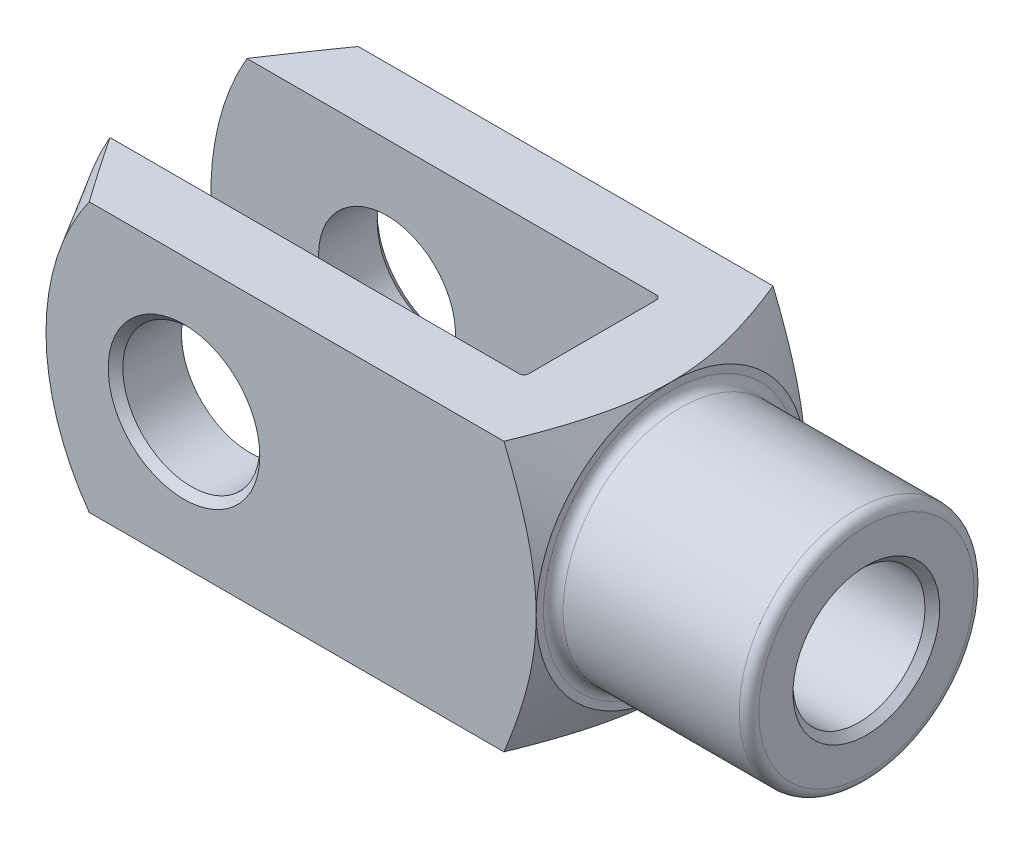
ISO-10303-21;
HEADER;
FILE_DESCRIPTION(('STEP AP214'),'2;1');
FILE_NAME('part.step','',(''),(''),'','','');
FILE_SCHEMA(('AUTOMOTIVE_DESIGN { 1 0 10303 214 1 1 1 1 }'));
ENDSEC;
DATA;
#1=APPLICATION_CONTEXT('core data for automotive mechanical design processes');
#2=APPLICATION_PROTOCOL_DEFINITION('international standard','automotive_design',2000,#1);
#3=PRODUCT_CONTEXT('',#1,'mechanical');
#4=PRODUCT('Part','Part','',(#3));
#5=PRODUCT_RELATED_PRODUCT_CATEGORY('part','',(#4));
#6=PRODUCT_DEFINITION_FORMATION('','',#4);
#7=PRODUCT_DEFINITION_CONTEXT('part definition',#1,'design');
#8=PRODUCT_DEFINITION('design','',#6,#7);
#9=PRODUCT_DEFINITION_SHAPE('','',#8);
#10=(LENGTH_UNIT() NAMED_UNIT(*) SI_UNIT(.MILLI.,.METRE.));
#11=(NAMED_UNIT(*) PLANE_ANGLE_UNIT() SI_UNIT($,.RADIAN.));
#12=(NAMED_UNIT(*) SI_UNIT($,.STERADIAN.) SOLID_ANGLE_UNIT());
#13=UNCERTAINTY_MEASURE_WITH_UNIT(LENGTH_MEASURE(1.E-05),#10,'distance_accuracy_value','');
#14=(GEOMETRIC_REPRESENTATION_CONTEXT(3) GLOBAL_UNCERTAINTY_ASSIGNED_CONTEXT((#13)) GLOBAL_UNIT_ASSIGNED_CONTEXT((#10,
#11,#12)) REPRESENTATION_CONTEXT('',''));
#15=CARTESIAN_POINT('',(0.,0.,0.));
#16=DIRECTION('',(0.,0.,1.));
#17=DIRECTION('',(1.,0.,0.));
#18=AXIS2_PLACEMENT_3D('',#15,#16,#17);
#19=CARTESIAN_POINT('',(-56.,-27.5,-14.));
#20=DIRECTION('',(1.,0.,0.));
#21=DIRECTION('',(0.,0.,-1.));
#22=AXIS2_PLACEMENT_3D('',#19,#20,#21);
#23=PLANE('',#22);
#24=DIRECTION('',(0.,1.,0.));
#25=VECTOR('',#24,1.);
#26=CARTESIAN_POINT('',(-56.,-27.5,-13.));
#27=LINE('',#26,#25);
#28=CARTESIAN_POINT('',(-56.,27.5,-13.));
#29=VERTEX_POINT('',#28);
#30=CARTESIAN_POINT('',(-56.,3.64005494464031,-13.));
#31=VERTEX_POINT('',#30);
#32=EDGE_CURVE('E154',#29,#31,#27,.F.);
#33=ORIENTED_EDGE('',*,*,#32,.T.);
#34=CARTESIAN_POINT('',(-56.,0.,0.));
#35=DIRECTION('',(1.,0.,0.));
#36=DIRECTION('',(0.,0.,-1.));
#37=AXIS2_PLACEMENT_3D('',#34,#35,#36);
#38=CIRCLE('',#37,13.5);
#39=CARTESIAN_POINT('',(-56.,3.64005494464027,13.));
#40=VERTEX_POINT('',#39);
#41=EDGE_CURVE('E139',#31,#40,#38,.T.);
#42=ORIENTED_EDGE('',*,*,#41,.T.);
#43=DIRECTION('',(0.,1.,0.));
#44=VECTOR('',#43,1.);
#45=CARTESIAN_POINT('',(-56.,27.5,13.));
#46=LINE('',#45,#44);
#47=CARTESIAN_POINT('',(-56.,27.5,13.));
#48=VERTEX_POINT('',#47);
#49=EDGE_CURVE('E151',#40,#48,#46,.T.);
#50=ORIENTED_EDGE('',*,*,#49,.T.);
#51=DIRECTION('',(0.,0.,-1.));
#52=VECTOR('',#51,1.);
#53=CARTESIAN_POINT('',(-56.,27.5,-14.));
#54=LINE('',#53,#52);
#55=EDGE_CURVE('E328',#48,#29,#54,.T.);
#56=ORIENTED_EDGE('',*,*,#55,.T.);
#57=EDGE_LOOP('',(#33,#42,#50,#56));
#58=FACE_BOUND('',#57,.T.);
#59=ADVANCED_FACE('F37',(#58),#23,.F.);
#60=CARTESIAN_POINT('',(-148.,-27.5,-14.));
#61=DIRECTION('',(0.,0.,-1.));
#62=DIRECTION('',(-1.,0.,0.));
#63=AXIS2_PLACEMENT_3D('',#60,#61,#62);
#64=PLANE('',#63);
#65=CARTESIAN_POINT('',(-112.,0.,-14.));
#66=DIRECTION('',(0.,0.,-1.));
#67=DIRECTION('',(-1.,0.,0.));
#68=AXIS2_PLACEMENT_3D('',#65,#66,#67);
#69=CIRCLE('',#68,14.);
#70=CARTESIAN_POINT('',(-126.,0.,-14.));
#71=VERTEX_POINT('',#70);
#72=EDGE_CURVE('E357',#71,#71,#69,.F.);
#73=ORIENTED_EDGE('',*,*,#72,.F.);
#74=EDGE_LOOP('',(#73));
#75=FACE_BOUND('',#74,.T.);
#76=DIRECTION('',(-1.,0.,0.));
#77=VECTOR('',#76,1.);
#78=CARTESIAN_POINT('',(-148.,27.5,-14.));
#79=LINE('',#78,#77);
#80=CARTESIAN_POINT('',(-57.,27.5,-14.));
#81=VERTEX_POINT('',#80);
#82=CARTESIAN_POINT('',(-140.631397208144,27.5,-14.));
#83=VERTEX_POINT('',#82);
#84=EDGE_CURVE('E336',#81,#83,#79,.T.);
#85=ORIENTED_EDGE('',*,*,#84,.T.);
#86=CARTESIAN_POINT('',(-93.,0.,-14.));
#87=DIRECTION('',(0.,0.,1.));
#88=DIRECTION('',(1.,0.,0.));
#89=AXIS2_PLACEMENT_3D('',#86,#87,#88);
#90=CIRCLE('',#89,55.);
#91=CARTESIAN_POINT('',(-140.631397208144,-27.5,-14.));
#92=VERTEX_POINT('',#91);
#93=EDGE_CURVE('E268',#83,#92,#90,.T.);
#94=ORIENTED_EDGE('',*,*,#93,.T.);
#95=DIRECTION('',(-1.,0.,0.));
#96=VECTOR('',#95,1.);
#97=CARTESIAN_POINT('',(-148.,-27.5,-14.));
#98=LINE('',#97,#96);
#99=CARTESIAN_POINT('',(-57.,-27.5,-14.));
#100=VERTEX_POINT('',#99);
#101=EDGE_CURVE('E324',#100,#92,#98,.T.);
#102=ORIENTED_EDGE('',*,*,#101,.F.);
#103=DIRECTION('',(0.,1.,0.));
#104=VECTOR('',#103,1.);
#105=CARTESIAN_POINT('',(-57.,27.5,-14.));
#106=LINE('',#105,#104);
#107=EDGE_CURVE('E178',#100,#81,#106,.T.);
#108=ORIENTED_EDGE('',*,*,#107,.T.);
#109=EDGE_LOOP('',(#85,#94,#102,#108));
#110=FACE_BOUND('',#109,.T.);
#111=ADVANCED_FACE('F367',(#75,#110),#64,.F.);
#112=CARTESIAN_POINT('',(-148.,-27.5,14.));
#113=DIRECTION('',(0.,0.,1.));
#114=DIRECTION('',(1.,0.,0.));
#115=AXIS2_PLACEMENT_3D('',#112,#113,#114);
#116=PLANE('',#115);
#117=CARTESIAN_POINT('',(-112.,0.,14.));
#118=DIRECTION('',(0.,0.,1.));
#119=DIRECTION('',(1.,0.,0.));
#120=AXIS2_PLACEMENT_3D('',#117,#118,#119);
#121=CIRCLE('',#120,14.);
#122=CARTESIAN_POINT('',(-98.,0.,14.));
#123=VERTEX_POINT('',#122);
#124=EDGE_CURVE('E335',#123,#123,#121,.F.);
#125=ORIENTED_EDGE('',*,*,#124,.F.);
#126=EDGE_LOOP('',(#125));
#127=FACE_BOUND('',#126,.T.);
#128=CARTESIAN_POINT('',(-93.,0.,14.));
#129=DIRECTION('',(0.,0.,1.));
#130=DIRECTION('',(1.,0.,0.));
#131=AXIS2_PLACEMENT_3D('',#128,#129,#130);
#132=CIRCLE('',#131,55.);
#133=CARTESIAN_POINT('',(-140.631397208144,27.5,14.));
#134=VERTEX_POINT('',#133);
#135=CARTESIAN_POINT('',(-140.631397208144,-27.5,14.));
#136=VERTEX_POINT('',#135);
#137=EDGE_CURVE('E385',#134,#136,#132,.T.);
#138=ORIENTED_EDGE('',*,*,#137,.F.);
#139=DIRECTION('',(1.,0.,0.));
#140=VECTOR('',#139,1.);
#141=CARTESIAN_POINT('',(-148.,27.5,14.));
#142=LINE('',#141,#140);
#143=CARTESIAN_POINT('',(-57.,27.5,14.));
#144=VERTEX_POINT('',#143);
#145=EDGE_CURVE('E340',#134,#144,#142,.T.);
#146=ORIENTED_EDGE('',*,*,#145,.T.);
#147=DIRECTION('',(0.,1.,0.));
#148=VECTOR('',#147,1.);
#149=CARTESIAN_POINT('',(-57.,-27.5,14.));
#150=LINE('',#149,#148);
#151=CARTESIAN_POINT('',(-57.,-27.5,14.));
#152=VERTEX_POINT('',#151);
#153=EDGE_CURVE('E169',#144,#152,#150,.F.);
#154=ORIENTED_EDGE('',*,*,#153,.T.);
#155=DIRECTION('',(1.,0.,0.));
#156=VECTOR('',#155,1.);
#157=CARTESIAN_POINT('',(-148.,-27.5,14.));
#158=LINE('',#157,#156);
#159=EDGE_CURVE('E327',#136,#152,#158,.T.);
#160=ORIENTED_EDGE('',*,*,#159,.F.);
#161=EDGE_LOOP('',(#138,#146,#154,#160));
#162=FACE_BOUND('',#161,.T.);
#163=ADVANCED_FACE('F370',(#127,#162),#116,.F.);
#164=CARTESIAN_POINT('',(-148.,-27.5,27.5));
#165=DIRECTION('',(0.,0.,1.));
#166=DIRECTION('',(1.,0.,0.));
#167=AXIS2_PLACEMENT_3D('',#164,#165,#166);
#168=PLANE('',#167);
#169=CARTESIAN_POINT('',(-112.,0.,27.5));
#170=DIRECTION('',(0.,0.,1.));
#171=DIRECTION('',(1.,0.,0.));
#172=AXIS2_PLACEMENT_3D('',#169,#170,#171);
#173=CIRCLE('',#172,15.5);
#174=CARTESIAN_POINT('',(-96.5,0.,27.5));
#175=VERTEX_POINT('',#174);
#176=EDGE_CURVE('E221',#175,#175,#173,.F.);
#177=ORIENTED_EDGE('',*,*,#176,.T.);
#178=EDGE_LOOP('',(#177));
#179=FACE_BOUND('',#178,.T.);
#180=DIRECTION('',(1.,0.,0.));
#181=VECTOR('',#180,1.);
#182=CARTESIAN_POINT('',(-148.,27.5,27.5));
#183=LINE('',#182,#181);
#184=CARTESIAN_POINT('',(-131.368409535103,27.5,27.5));
#185=VERTEX_POINT('',#184);
#186=CARTESIAN_POINT('',(-46.5765235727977,27.5,27.5));
#187=VERTEX_POINT('',#186);
#188=EDGE_CURVE('E354',#185,#187,#183,.T.);
#189=ORIENTED_EDGE('',*,*,#188,.F.);
#190=CARTESIAN_POINT('',(-93.,0.,27.5));
#191=DIRECTION('',(0.,0.,1.));
#192=DIRECTION('',(1.,0.,0.));
#193=AXIS2_PLACEMENT_3D('',#190,#191,#192);
#194=CIRCLE('',#193,47.20577136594);
#195=CARTESIAN_POINT('',(-131.368409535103,-27.5,27.5));
#196=VERTEX_POINT('',#195);
#197=EDGE_CURVE('E61',#185,#196,#194,.T.);
#198=ORIENTED_EDGE('',*,*,#197,.T.);
#199=DIRECTION('',(1.,0.,0.));
#200=VECTOR('',#199,1.);
#201=CARTESIAN_POINT('',(-148.,-27.5,27.5));
#202=LINE('',#201,#200);
#203=CARTESIAN_POINT('',(-46.5765235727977,-27.5,27.5));
#204=VERTEX_POINT('',#203);
#205=EDGE_CURVE('E351',#196,#204,#202,.T.);
#206=ORIENTED_EDGE('',*,*,#205,.T.);
#207=CARTESIAN_POINT('',(-60.2286520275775,-56.1661197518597,27.5));
#208=CARTESIAN_POINT('',(-59.877263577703,-55.488454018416,27.5));
#209=CARTESIAN_POINT('',(-59.5268382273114,-54.8102891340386,27.5));
#210=CARTESIAN_POINT('',(-58.8281196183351,-53.4528592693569,27.5));
#211=CARTESIAN_POINT('',(-58.4798263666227,-52.7735942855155,27.5));
#212=CARTESIAN_POINT('',(-57.4384219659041,-50.7339344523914,27.5));
#213=CARTESIAN_POINT('',(-56.748821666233,-49.3717430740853,27.5));
#214=CARTESIAN_POINT('',(-55.379898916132,-46.6392326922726,27.5));
#215=CARTESIAN_POINT('',(-54.700596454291,-45.2689036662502,27.5));
#216=CARTESIAN_POINT('',(-53.3562706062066,-42.5212693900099,27.5));
#217=CARTESIAN_POINT('',(-52.6912469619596,-41.1439642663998,27.5));
#218=CARTESIAN_POINT('',(-51.6870177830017,-39.0290973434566,27.5));
#219=CARTESIAN_POINT('',(-51.3413523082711,-38.2946014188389,27.5));
#220=CARTESIAN_POINT('',(-50.6557933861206,-36.8229224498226,27.5));
#221=CARTESIAN_POINT('',(-50.3158999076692,-36.0857394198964,27.5));
#222=CARTESIAN_POINT('',(-49.6426674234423,-34.6083269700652,27.5));
#223=CARTESIAN_POINT('',(-49.3093288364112,-33.8680973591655,27.5));
#224=CARTESIAN_POINT('',(-48.6501852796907,-32.3842946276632,27.5));
#225=CARTESIAN_POINT('',(-48.3243802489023,-31.6407215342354,27.5));
#226=CARTESIAN_POINT('',(-47.6815641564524,-30.1501576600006,27.5));
#227=CARTESIAN_POINT('',(-47.3645493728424,-29.4031684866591,27.5));
#228=CARTESIAN_POINT('',(-46.7405004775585,-27.9050353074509,27.5));
#229=CARTESIAN_POINT('',(-46.4334662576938,-27.1538913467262,27.5));
#230=CARTESIAN_POINT('',(-45.8309720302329,-25.6470429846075,27.5));
#231=CARTESIAN_POINT('',(-45.535510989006,-24.8913389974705,27.5));
#232=CARTESIAN_POINT('',(-44.9579969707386,-23.374828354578,27.5));
#233=CARTESIAN_POINT('',(-44.6759438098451,-22.6140217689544,27.5));
#234=CARTESIAN_POINT('',(-44.0679304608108,-20.9211908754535,27.5));
#235=CARTESIAN_POINT('',(-43.7457124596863,-19.9878144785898,27.5));
#236=CARTESIAN_POINT('',(-43.1290045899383,-18.1119849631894,27.5));
#237=CARTESIAN_POINT('',(-42.8345123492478,-17.1695326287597,27.5));
#238=CARTESIAN_POINT('',(-42.2787221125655,-15.2748429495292,27.5));
#239=CARTESIAN_POINT('',(-42.0174234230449,-14.3226058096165,27.5));
#240=CARTESIAN_POINT('',(-41.5342616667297,-12.4080936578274,27.5));
#241=CARTESIAN_POINT('',(-41.3123981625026,-11.4458187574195,27.5));
#242=CARTESIAN_POINT('',(-40.9194598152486,-9.53441211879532,27.5));
#243=CARTESIAN_POINT('',(-40.7473150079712,-8.58550210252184,27.5));
#244=CARTESIAN_POINT('',(-40.4530867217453,-6.67982263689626,27.5));
#245=CARTESIAN_POINT('',(-40.331001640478,-5.72305344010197,27.5));
#246=CARTESIAN_POINT('',(-40.1891957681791,-4.28420703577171,27.5));
#247=CARTESIAN_POINT('',(-40.1488192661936,-3.80410222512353,27.5));
#248=CARTESIAN_POINT('',(-40.0822400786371,-2.84291838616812,27.5));
#249=CARTESIAN_POINT('',(-40.0560367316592,-2.36183940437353,27.5));
#250=CARTESIAN_POINT('',(-40.0181172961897,-1.39910944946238,27.5));
#251=CARTESIAN_POINT('',(-40.0064011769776,-0.917458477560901,27.5));
#252=CARTESIAN_POINT('',(-39.9975849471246,0.0459618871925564,27.5));
#253=CARTESIAN_POINT('',(-40.0004847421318,0.527731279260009,27.5));
#254=CARTESIAN_POINT('',(-40.0296149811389,1.90235979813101,27.5));
#255=CARTESIAN_POINT('',(-40.0736560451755,2.79490249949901,27.5));
#256=CARTESIAN_POINT('',(-40.2102476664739,4.57617108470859,27.5));
#257=CARTESIAN_POINT('',(-40.3027981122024,5.46489697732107,27.5));
#258=CARTESIAN_POINT('',(-40.5329956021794,7.23690381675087,27.5));
#259=CARTESIAN_POINT('',(-40.6706659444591,8.12018170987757,27.5));
#260=CARTESIAN_POINT('',(-40.9865696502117,9.87940375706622,27.5));
#261=CARTESIAN_POINT('',(-41.1648041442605,10.7553477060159,27.5));
#262=CARTESIAN_POINT('',(-41.5625503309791,12.5244022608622,27.5));
#263=CARTESIAN_POINT('',(-41.7831074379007,13.4172759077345,27.5));
#264=CARTESIAN_POINT('',(-42.2566003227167,15.1943548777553,27.5));
#265=CARTESIAN_POINT('',(-42.5095364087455,16.0785601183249,27.5));
#266=CARTESIAN_POINT('',(-42.9095547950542,17.3985328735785,27.5));
#267=CARTESIAN_POINT('',(-43.0463285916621,17.8374638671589,27.5));
#268=CARTESIAN_POINT('',(-43.3262073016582,18.7133062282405,27.5));
#269=CARTESIAN_POINT('',(-43.469312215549,19.1502175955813,27.5));
#270=CARTESIAN_POINT('',(-43.7613249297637,20.0220652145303,27.5));
#271=CARTESIAN_POINT('',(-43.9102323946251,20.4570015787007,27.5));
#272=CARTESIAN_POINT('',(-44.2133836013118,21.3250056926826,27.5));
#273=CARTESIAN_POINT('',(-44.3676273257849,21.7580734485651,27.5));
#274=CARTESIAN_POINT('',(-44.8632318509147,23.1250498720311,27.5));
#275=CARTESIAN_POINT('',(-45.2135920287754,24.0557046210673,27.5));
#276=CARTESIAN_POINT('',(-45.9333349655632,25.9096511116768,27.5));
#277=CARTESIAN_POINT('',(-46.3027188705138,26.8329424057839,27.5));
#278=CARTESIAN_POINT('',(-47.0574378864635,28.6732112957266,27.5));
#279=CARTESIAN_POINT('',(-47.4427765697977,29.59018742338,27.5));
#280=CARTESIAN_POINT('',(-48.2267507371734,31.4184035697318,27.5));
#281=CARTESIAN_POINT('',(-48.6253859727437,32.3296436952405,27.5));
#282=CARTESIAN_POINT('',(-49.4342203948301,34.1479110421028,27.5));
#283=CARTESIAN_POINT('',(-49.8444292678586,35.054933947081,27.5));
#284=CARTESIAN_POINT('',(-50.674373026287,36.8646088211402,27.5));
#285=CARTESIAN_POINT('',(-51.0941079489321,37.7672607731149,27.5));
#286=CARTESIAN_POINT('',(-51.9416536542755,39.5686363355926,27.5));
#287=CARTESIAN_POINT('',(-52.3694635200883,40.4673603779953,27.5));
#288=CARTESIAN_POINT('',(-53.232051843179,42.2614529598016,27.5));
#289=CARTESIAN_POINT('',(-53.6668302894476,43.1568215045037,27.5));
#290=CARTESIAN_POINT('',(-54.5437336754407,44.9473331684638,27.5));
#291=CARTESIAN_POINT('',(-54.9858769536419,45.8424672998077,27.5));
#292=CARTESIAN_POINT('',(-55.8754180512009,47.6301222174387,27.5));
#293=CARTESIAN_POINT('',(-56.3228158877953,48.5226429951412,27.5));
#294=CARTESIAN_POINT('',(-57.6718703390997,51.1967817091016,27.5));
#295=CARTESIAN_POINT('',(-58.5803735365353,52.9749468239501,27.5));
#296=CARTESIAN_POINT('',(-60.4109841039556,56.5231320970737,27.5));
#297=CARTESIAN_POINT('',(-61.3330845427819,58.2931558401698,27.5));
#298=CARTESIAN_POINT('',(-63.1883406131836,61.8273779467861,27.5));
#299=CARTESIAN_POINT('',(-64.1214961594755,63.5915763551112,27.5));
#300=CARTESIAN_POINT('',(-65.857416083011,66.8536122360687,27.5));
#301=CARTESIAN_POINT('',(-66.6589641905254,68.3520976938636,27.5));
#302=CARTESIAN_POINT('',(-68.2674305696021,71.3461851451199,27.5));
#303=CARTESIAN_POINT('',(-69.0743488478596,72.8417871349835,27.5));
#304=CARTESIAN_POINT('',(-70.6928273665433,75.830747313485,27.5));
#305=CARTESIAN_POINT('',(-71.5043882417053,77.3241051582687,27.5));
#306=CARTESIAN_POINT('',(-73.1313659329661,80.3087190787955,27.5));
#307=CARTESIAN_POINT('',(-73.9467827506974,81.7999751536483,27.5));
#308=CARTESIAN_POINT('',(-75.5762426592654,84.7721370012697,27.5));
#309=CARTESIAN_POINT('',(-76.3902668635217,86.253053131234,27.5));
#310=CARTESIAN_POINT('',(-78.0211422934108,89.2133282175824,27.5));
#311=CARTESIAN_POINT('',(-78.8379935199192,90.6926871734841,27.5));
#312=CARTESIAN_POINT('',(-80.4740235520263,93.6498117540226,27.5));
#313=CARTESIAN_POINT('',(-81.2932019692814,95.1275775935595,27.5));
#314=CARTESIAN_POINT('',(-82.9337176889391,98.0819083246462,27.5));
#315=CARTESIAN_POINT('',(-83.7550549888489,99.55847321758,27.5));
#316=CARTESIAN_POINT('',(-84.5773240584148,101.034518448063,27.5));
#317=B_SPLINE_CURVE_WITH_KNOTS('',3,(#207,#208,#209,#210,#211,#212,#213,#214,#215,#216,#217,
#218,#219,#220,#221,#222,#223,#224,#225,#226,#227,#228,#229,#230,#231,#232,#233,#234,#235,#236,
#237,#238,#239,#240,#241,#242,#243,#244,#245,#246,#247,#248,#249,#250,#251,#252,#253,#254,#255,
#256,#257,#258,#259,#260,#261,#262,#263,#264,#265,#266,#267,#268,#269,#270,#271,#272,#273,#274,
#275,#276,#277,#278,#279,#280,#281,#282,#283,#284,#285,#286,#287,#288,#289,#290,#291,#292,#293,
#294,#295,#296,#297,#298,#299,#300,#301,#302,#303,#304,#305,#306,#307,#308,#309,#310,#311,#312,
#313,#314,#315,#316),.UNSPECIFIED.,.F.,.F.,(4,2,2,2,2,2,2,2,2,2,2,2,2,2,2,2,2,2,2,2,2,2,2,2,2,2,
2,2,2,2,2,2,2,2,2,2,2,2,2,2,2,2,2,2,2,2,2,2,2,2,2,2,2,2,4),(0.,2.29005127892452,
4.58010993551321,9.16045830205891,13.7487827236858,18.3370241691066,20.7723109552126,
23.2075846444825,25.643013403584,28.0784224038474,30.5127839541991,32.9471191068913,
35.3812363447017,37.8153201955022,40.7772407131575,43.7389075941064,46.7005125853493,
49.6620847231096,52.5541365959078,55.4460958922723,56.8913195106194,58.3364756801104,
59.7816287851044,61.226772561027,63.9061566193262,66.5855345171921,69.266298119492,
71.9471364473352,74.7055692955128,77.4640283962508,78.8432321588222,80.2224360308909,
81.6015602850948,82.9806800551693,85.9636558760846,88.9468116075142,91.930638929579,
94.9144105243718,97.9007581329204,100.887117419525,103.873139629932,106.859157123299,
109.85426683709,112.849386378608,118.839723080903,124.827105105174,130.814440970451,
135.912609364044,141.010784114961,146.109673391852,151.208564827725,156.278248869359,
161.347934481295,166.416818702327,171.485697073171),.UNSPECIFIED.);
#318=CARTESIAN_POINT('',(-40.,0.,27.5));
#319=VERTEX_POINT('',#318);
#320=EDGE_CURVE('E296',#319,#204,#317,.F.);
#321=ORIENTED_EDGE('',*,*,#320,.F.);
#322=EDGE_CURVE('E294',#187,#319,#317,.F.);
#323=ORIENTED_EDGE('',*,*,#322,.F.);
#324=EDGE_LOOP('',(#189,#198,#206,#321,#323));
#325=FACE_BOUND('',#324,.T.);
#326=ADVANCED_FACE('F279',(#179,#325),#168,.T.);
#327=CARTESIAN_POINT('',(-148.,-27.5,27.5));
#328=DIRECTION('',(0.,-1.,0.));
#329=DIRECTION('',(0.,0.,-1.));
#330=AXIS2_PLACEMENT_3D('',#327,#328,#329);
#331=PLANE('',#330);
#332=ORIENTED_EDGE('',*,*,#101,.T.);
#333=CARTESIAN_POINT('',(-175.072820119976,-27.5,40.6591633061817));
#334=CARTESIAN_POINT('',(-174.31407738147,-27.5,39.4130762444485));
#335=CARTESIAN_POINT('',(-173.554564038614,-27.5,38.1674584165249));
#336=CARTESIAN_POINT('',(-172.033855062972,-27.5,35.6772496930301));
#337=CARTESIAN_POINT('',(-171.272659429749,-27.5,34.4326587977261));
#338=CARTESIAN_POINT('',(-168.986325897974,-27.5,30.700540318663));
#339=CARTESIAN_POINT('',(-167.458453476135,-27.5,28.21468683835));
#340=CARTESIAN_POINT('',(-164.393853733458,-27.5,23.2480325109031));
#341=CARTESIAN_POINT('',(-162.857125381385,-27.5,20.767232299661));
#342=CARTESIAN_POINT('',(-160.544189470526,-27.5,17.0509206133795));
#343=CARTESIAN_POINT('',(-159.771905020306,-27.5,15.8129670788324));
#344=CARTESIAN_POINT('',(-158.224440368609,-27.5,13.3388665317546));
#345=CARTESIAN_POINT('',(-157.449260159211,-27.5,12.1027195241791));
#346=CARTESIAN_POINT('',(-155.122376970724,-27.5,8.40276427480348));
#347=CARTESIAN_POINT('',(-153.565914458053,-27.5,5.94194577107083));
#348=CARTESIAN_POINT('',(-150.437298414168,-27.5,1.03030295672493));
#349=CARTESIAN_POINT('',(-148.865144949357,-27.5,-1.42052139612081));
#350=CARTESIAN_POINT('',(-146.49201790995,-27.5,-5.08719073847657));
#351=CARTESIAN_POINT('',(-145.698475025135,-27.5,-6.30784623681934));
#352=CARTESIAN_POINT('',(-144.105765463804,-27.5,-8.74548151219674));
#353=CARTESIAN_POINT('',(-143.306598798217,-27.5,-9.96246129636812));
#354=CARTESIAN_POINT('',(-141.701880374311,-27.5,-12.3921897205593));
#355=CARTESIAN_POINT('',(-140.896328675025,-27.5,-13.6049383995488));
#356=CARTESIAN_POINT('',(-139.277910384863,-27.5,-16.0255422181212));
#357=CARTESIAN_POINT('',(-138.465043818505,-27.5,-17.2333973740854));
#358=CARTESIAN_POINT('',(-136.829559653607,-27.5,-19.6453400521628));
#359=CARTESIAN_POINT('',(-136.006928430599,-27.5,-20.8494183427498));
#360=CARTESIAN_POINT('',(-134.351848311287,-27.5,-23.2508006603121));
#361=CARTESIAN_POINT('',(-133.519399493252,-27.5,-24.4481047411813));
#362=CARTESIAN_POINT('',(-131.843199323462,-27.5,-26.8343488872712));
#363=CARTESIAN_POINT('',(-130.999450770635,-27.5,-28.0232909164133));
#364=CARTESIAN_POINT('',(-129.2983336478,-27.5,-30.39145409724));
#365=CARTESIAN_POINT('',(-128.440964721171,-27.5,-31.5706749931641));
#366=CARTESIAN_POINT('',(-126.708925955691,-27.5,-33.9185712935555));
#367=CARTESIAN_POINT('',(-125.834236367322,-27.5,-35.0872321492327));
#368=CARTESIAN_POINT('',(-124.065221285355,-27.5,-37.4095168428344));
#369=CARTESIAN_POINT('',(-123.170897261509,-27.5,-38.5631417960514));
#370=CARTESIAN_POINT('',(-121.810939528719,-27.5,-40.2796624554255));
#371=CARTESIAN_POINT('',(-121.354359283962,-27.5,-40.8497370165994));
#372=CARTESIAN_POINT('',(-120.434440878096,-27.5,-41.9843978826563));
#373=CARTESIAN_POINT('',(-119.971102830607,-27.5,-42.5489842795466));
#374=CARTESIAN_POINT('',(-119.036762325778,-27.5,-43.6720267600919));
#375=CARTESIAN_POINT('',(-118.565757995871,-27.5,-44.2304812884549));
#376=CARTESIAN_POINT('',(-117.615206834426,-27.5,-45.3401243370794));
#377=CARTESIAN_POINT('',(-117.135659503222,-27.5,-45.8913124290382));
#378=CARTESIAN_POINT('',(-116.651373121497,-27.5,-46.4383377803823));
#379=B_SPLINE_CURVE_WITH_KNOTS('',3,(#333,#334,#335,#336,#337,#338,#339,#340,#341,#342,#343,
#344,#345,#346,#347,#348,#349,#350,#351,#352,#353,#354,#355,#356,#357,#358,#359,#360,#361,#362,
#363,#364,#365,#366,#367,#368,#369,#370,#371,#372,#373,#374,#375,#376,#377,#378),.UNSPECIFIED.,
.F.,.F.,(4,2,2,2,2,2,2,2,2,2,2,2,2,2,2,2,2,2,2,2,2,2,4),(0.,4.37673483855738,8.75347081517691,
17.5070126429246,26.2615952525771,30.638870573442,35.0161578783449,43.7513177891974,
52.4864407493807,56.8541956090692,61.2219419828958,65.5896480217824,69.9573394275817,
74.3320826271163,78.7067909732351,83.0804350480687,87.4541938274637,91.8332651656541,
96.2120098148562,98.4030985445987,100.594150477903,102.785745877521,104.977469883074),.UNSPECIFIED.);
#380=CARTESIAN_POINT('',(-131.368409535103,-27.5,-27.5));
#381=VERTEX_POINT('',#380);
#382=EDGE_CURVE('E267',#92,#381,#379,.T.);
#383=ORIENTED_EDGE('',*,*,#382,.T.);
#384=DIRECTION('',(1.,0.,0.));
#385=VECTOR('',#384,1.);
#386=CARTESIAN_POINT('',(-148.,-27.5,-27.5));
#387=LINE('',#386,#385);
#388=CARTESIAN_POINT('',(-46.5765235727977,-27.5,-27.5));
#389=VERTEX_POINT('',#388);
#390=EDGE_CURVE('E348',#381,#389,#387,.T.);
#391=ORIENTED_EDGE('',*,*,#390,.T.);
#392=CARTESIAN_POINT('',(-60.2286520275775,-27.5,-56.1661197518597));
#393=CARTESIAN_POINT('',(-59.877263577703,-27.5,-55.488454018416));
#394=CARTESIAN_POINT('',(-59.5268382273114,-27.5,-54.8102891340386));
#395=CARTESIAN_POINT('',(-58.8281196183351,-27.5,-53.4528592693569));
#396=CARTESIAN_POINT('',(-58.4798263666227,-27.5,-52.7735942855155));
#397=CARTESIAN_POINT('',(-57.4384219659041,-27.5,-50.7339344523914));
#398=CARTESIAN_POINT('',(-56.748821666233,-27.5,-49.3717430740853));
#399=CARTESIAN_POINT('',(-55.379898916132,-27.5,-46.6392326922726));
#400=CARTESIAN_POINT('',(-54.700596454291,-27.5,-45.2689036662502));
#401=CARTESIAN_POINT('',(-53.3562706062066,-27.5,-42.5212693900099));
#402=CARTESIAN_POINT('',(-52.6912469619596,-27.5,-41.1439642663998));
#403=CARTESIAN_POINT('',(-51.6870177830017,-27.5,-39.0290973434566));
#404=CARTESIAN_POINT('',(-51.3413523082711,-27.5,-38.2946014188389));
#405=CARTESIAN_POINT('',(-50.6557933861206,-27.5,-36.8229224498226));
#406=CARTESIAN_POINT('',(-50.3158999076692,-27.5,-36.0857394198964));
#407=CARTESIAN_POINT('',(-49.6426674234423,-27.5,-34.6083269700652));
#408=CARTESIAN_POINT('',(-49.3093288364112,-27.5,-33.8680973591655));
#409=CARTESIAN_POINT('',(-48.6501852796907,-27.5,-32.3842946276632));
#410=CARTESIAN_POINT('',(-48.3243802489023,-27.5,-31.6407215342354));
#411=CARTESIAN_POINT('',(-47.6815641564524,-27.5,-30.1501576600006));
#412=CARTESIAN_POINT('',(-47.3645493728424,-27.5,-29.4031684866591));
#413=CARTESIAN_POINT('',(-46.7405004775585,-27.5,-27.9050353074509));
#414=CARTESIAN_POINT('',(-46.4334662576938,-27.5,-27.1538913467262));
#415=CARTESIAN_POINT('',(-45.8309720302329,-27.5,-25.6470429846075));
#416=CARTESIAN_POINT('',(-45.535510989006,-27.5,-24.8913389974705));
#417=CARTESIAN_POINT('',(-44.9579969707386,-27.5,-23.374828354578));
#418=CARTESIAN_POINT('',(-44.6759438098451,-27.5,-22.6140217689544));
#419=CARTESIAN_POINT('',(-44.0679304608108,-27.5,-20.9211908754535));
#420=CARTESIAN_POINT('',(-43.7457124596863,-27.5,-19.9878144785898));
#421=CARTESIAN_POINT('',(-43.1290045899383,-27.5,-18.1119849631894));
#422=CARTESIAN_POINT('',(-42.8345123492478,-27.5,-17.1695326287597));
#423=CARTESIAN_POINT('',(-42.2787221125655,-27.5,-15.2748429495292));
#424=CARTESIAN_POINT('',(-42.0174234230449,-27.5,-14.3226058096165));
#425=CARTESIAN_POINT('',(-41.5342616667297,-27.5,-12.4080936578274));
#426=CARTESIAN_POINT('',(-41.3123981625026,-27.5,-11.4458187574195));
#427=CARTESIAN_POINT('',(-40.9194598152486,-27.5,-9.53441211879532));
#428=CARTESIAN_POINT('',(-40.7473150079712,-27.5,-8.58550210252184));
#429=CARTESIAN_POINT('',(-40.4530867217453,-27.5,-6.67982263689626));
#430=CARTESIAN_POINT('',(-40.331001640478,-27.5,-5.72305344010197));
#431=CARTESIAN_POINT('',(-40.1891957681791,-27.5,-4.28420703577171));
#432=CARTESIAN_POINT('',(-40.1488192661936,-27.5,-3.80410222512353));
#433=CARTESIAN_POINT('',(-40.0822400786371,-27.5,-2.84291838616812));
#434=CARTESIAN_POINT('',(-40.0560367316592,-27.5,-2.36183940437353));
#435=CARTESIAN_POINT('',(-40.0181172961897,-27.5,-1.39910944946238));
#436=CARTESIAN_POINT('',(-40.0064011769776,-27.5,-0.917458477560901));
#437=CARTESIAN_POINT('',(-39.9975849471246,-27.5,0.0459618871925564));
#438=CARTESIAN_POINT('',(-40.0004847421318,-27.5,0.527731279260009));
#439=CARTESIAN_POINT('',(-40.0296149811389,-27.5,1.90235979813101));
#440=CARTESIAN_POINT('',(-40.0736560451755,-27.5,2.79490249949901));
#441=CARTESIAN_POINT('',(-40.2102476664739,-27.5,4.57617108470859));
#442=CARTESIAN_POINT('',(-40.3027981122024,-27.5,5.46489697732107));
#443=CARTESIAN_POINT('',(-40.5329956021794,-27.5,7.23690381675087));
#444=CARTESIAN_POINT('',(-40.6706659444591,-27.5,8.12018170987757));
#445=CARTESIAN_POINT('',(-40.9865696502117,-27.5,9.87940375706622));
#446=CARTESIAN_POINT('',(-41.1648041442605,-27.5,10.7553477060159));
#447=CARTESIAN_POINT('',(-41.5625503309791,-27.5,12.5244022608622));
#448=CARTESIAN_POINT('',(-41.7831074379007,-27.5,13.4172759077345));
#449=CARTESIAN_POINT('',(-42.2566003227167,-27.5,15.1943548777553));
#450=CARTESIAN_POINT('',(-42.5095364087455,-27.5,16.0785601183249));
#451=CARTESIAN_POINT('',(-42.9095547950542,-27.5,17.3985328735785));
#452=CARTESIAN_POINT('',(-43.0463285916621,-27.5,17.8374638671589));
#453=CARTESIAN_POINT('',(-43.3262073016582,-27.5,18.7133062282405));
#454=CARTESIAN_POINT('',(-43.469312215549,-27.5,19.1502175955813));
#455=CARTESIAN_POINT('',(-43.7613249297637,-27.5,20.0220652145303));
#456=CARTESIAN_POINT('',(-43.9102323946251,-27.5,20.4570015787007));
#457=CARTESIAN_POINT('',(-44.2133836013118,-27.5,21.3250056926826));
#458=CARTESIAN_POINT('',(-44.3676273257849,-27.5,21.7580734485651));
#459=CARTESIAN_POINT('',(-44.8632318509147,-27.5,23.1250498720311));
#460=CARTESIAN_POINT('',(-45.2135920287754,-27.5,24.0557046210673));
#461=CARTESIAN_POINT('',(-45.9333349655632,-27.5,25.9096511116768));
#462=CARTESIAN_POINT('',(-46.3027188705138,-27.5,26.8329424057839));
#463=CARTESIAN_POINT('',(-47.0574378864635,-27.5,28.6732112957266));
#464=CARTESIAN_POINT('',(-47.4427765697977,-27.5,29.59018742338));
#465=CARTESIAN_POINT('',(-48.2267507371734,-27.5,31.4184035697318));
#466=CARTESIAN_POINT('',(-48.6253859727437,-27.5,32.3296436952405));
#467=CARTESIAN_POINT('',(-49.4342203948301,-27.5,34.1479110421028));
#468=CARTESIAN_POINT('',(-49.8444292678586,-27.5,35.054933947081));
#469=CARTESIAN_POINT('',(-50.674373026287,-27.5,36.8646088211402));
#470=CARTESIAN_POINT('',(-51.0941079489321,-27.5,37.7672607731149));
#471=CARTESIAN_POINT('',(-51.9416536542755,-27.5,39.5686363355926));
#472=CARTESIAN_POINT('',(-52.3694635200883,-27.5,40.4673603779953));
#473=CARTESIAN_POINT('',(-53.232051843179,-27.5,42.2614529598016));
#474=CARTESIAN_POINT('',(-53.6668302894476,-27.5,43.1568215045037));
#475=CARTESIAN_POINT('',(-54.5437336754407,-27.5,44.9473331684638));
#476=CARTESIAN_POINT('',(-54.9858769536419,-27.5,45.8424672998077));
#477=CARTESIAN_POINT('',(-55.8754180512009,-27.5,47.6301222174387));
#478=CARTESIAN_POINT('',(-56.3228158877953,-27.5,48.5226429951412));
#479=CARTESIAN_POINT('',(-57.6718703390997,-27.5,51.1967817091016));
#480=CARTESIAN_POINT('',(-58.5803735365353,-27.5,52.9749468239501));
#481=CARTESIAN_POINT('',(-60.4109841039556,-27.5,56.5231320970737));
#482=CARTESIAN_POINT('',(-61.3330845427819,-27.5,58.2931558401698));
#483=CARTESIAN_POINT('',(-63.1883406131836,-27.5,61.8273779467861));
#484=CARTESIAN_POINT('',(-64.1214961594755,-27.5,63.5915763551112));
#485=CARTESIAN_POINT('',(-65.857416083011,-27.5,66.8536122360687));
#486=CARTESIAN_POINT('',(-66.6589641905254,-27.5,68.3520976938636));
#487=CARTESIAN_POINT('',(-68.2674305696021,-27.5,71.3461851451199));
#488=CARTESIAN_POINT('',(-69.0743488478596,-27.5,72.8417871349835));
#489=CARTESIAN_POINT('',(-70.6928273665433,-27.5,75.830747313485));
#490=CARTESIAN_POINT('',(-71.5043882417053,-27.5,77.3241051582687));
#491=CARTESIAN_POINT('',(-73.1313659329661,-27.5,80.3087190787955));
#492=CARTESIAN_POINT('',(-73.9467827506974,-27.5,81.7999751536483));
#493=CARTESIAN_POINT('',(-75.5762426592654,-27.5,84.7721370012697));
#494=CARTESIAN_POINT('',(-76.3902668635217,-27.5,86.253053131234));
#495=CARTESIAN_POINT('',(-78.0211422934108,-27.5,89.2133282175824));
#496=CARTESIAN_POINT('',(-78.8379935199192,-27.5,90.6926871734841));
#497=CARTESIAN_POINT('',(-80.4740235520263,-27.5,93.6498117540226));
#498=CARTESIAN_POINT('',(-81.2932019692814,-27.5,95.1275775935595));
#499=CARTESIAN_POINT('',(-82.9337176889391,-27.5,98.0819083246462));
#500=CARTESIAN_POINT('',(-83.7550549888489,-27.5,99.55847321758));
#501=CARTESIAN_POINT('',(-84.5773240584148,-27.5,101.034518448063));
#502=B_SPLINE_CURVE_WITH_KNOTS('',3,(#392,#393,#394,#395,#396,#397,#398,#399,#400,#401,#402,
#403,#404,#405,#406,#407,#408,#409,#410,#411,#412,#413,#414,#415,#416,#417,#418,#419,#420,#421,
#422,#423,#424,#425,#426,#427,#428,#429,#430,#431,#432,#433,#434,#435,#436,#437,#438,#439,#440,
#441,#442,#443,#444,#445,#446,#447,#448,#449,#450,#451,#452,#453,#454,#455,#456,#457,#458,#459,
#460,#461,#462,#463,#464,#465,#466,#467,#468,#469,#470,#471,#472,#473,#474,#475,#476,#477,#478,
#479,#480,#481,#482,#483,#484,#485,#486,#487,#488,#489,#490,#491,#492,#493,#494,#495,#496,#497,
#498,#499,#500,#501),.UNSPECIFIED.,.F.,.F.,(4,2,2,2,2,2,2,2,2,2,2,2,2,2,2,2,2,2,2,2,2,2,2,2,2,2,
2,2,2,2,2,2,2,2,2,2,2,2,2,2,2,2,2,2,2,2,2,2,2,2,2,2,2,2,4),(0.,2.29005127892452,
4.58010993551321,9.16045830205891,13.7487827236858,18.3370241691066,20.7723109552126,
23.2075846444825,25.643013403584,28.0784224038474,30.5127839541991,32.9471191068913,
35.3812363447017,37.8153201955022,40.7772407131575,43.7389075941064,46.7005125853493,
49.6620847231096,52.5541365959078,55.4460958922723,56.8913195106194,58.3364756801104,
59.7816287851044,61.226772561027,63.9061566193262,66.5855345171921,69.266298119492,
71.9471364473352,74.7055692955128,77.4640283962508,78.8432321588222,80.2224360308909,
81.6015602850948,82.9806800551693,85.9636558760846,88.9468116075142,91.930638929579,
94.9144105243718,97.9007581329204,100.887117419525,103.873139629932,106.859157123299,
109.85426683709,112.849386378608,118.839723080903,124.827105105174,130.814440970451,
135.912609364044,141.010784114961,146.109673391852,151.208564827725,156.278248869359,
161.347934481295,166.416818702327,171.485697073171),.UNSPECIFIED.);
#503=CARTESIAN_POINT('',(-40.,-27.5,0.));
#504=VERTEX_POINT('',#503);
#505=EDGE_CURVE('E295',#504,#389,#502,.F.);
#506=ORIENTED_EDGE('',*,*,#505,.F.);
#507=EDGE_CURVE('E287',#204,#504,#502,.F.);
#508=ORIENTED_EDGE('',*,*,#507,.F.);
#509=ORIENTED_EDGE('',*,*,#205,.F.);
#510=CARTESIAN_POINT('',(-116.651373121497,-27.5,46.4383377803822));
#511=CARTESIAN_POINT('',(-117.135659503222,-27.5,45.8913124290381));
#512=CARTESIAN_POINT('',(-117.615206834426,-27.5,45.3401243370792));
#513=CARTESIAN_POINT('',(-118.565757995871,-27.5,44.2304812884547));
#514=CARTESIAN_POINT('',(-119.036762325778,-27.5,43.6720267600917));
#515=CARTESIAN_POINT('',(-119.971102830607,-27.5,42.5489842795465));
#516=CARTESIAN_POINT('',(-120.434440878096,-27.5,41.9843978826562));
#517=CARTESIAN_POINT('',(-121.354359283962,-27.5,40.8497370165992));
#518=CARTESIAN_POINT('',(-121.810939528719,-27.5,40.2796624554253));
#519=CARTESIAN_POINT('',(-123.170897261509,-27.5,38.5631417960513));
#520=CARTESIAN_POINT('',(-124.065221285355,-27.5,37.4095168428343));
#521=CARTESIAN_POINT('',(-125.834236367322,-27.5,35.0872321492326));
#522=CARTESIAN_POINT('',(-126.708925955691,-27.5,33.9185712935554));
#523=CARTESIAN_POINT('',(-128.440964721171,-27.5,31.570674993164));
#524=CARTESIAN_POINT('',(-129.2983336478,-27.5,30.3914540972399));
#525=CARTESIAN_POINT('',(-130.999450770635,-27.5,28.0232909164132));
#526=CARTESIAN_POINT('',(-131.843199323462,-27.5,26.8343488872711));
#527=CARTESIAN_POINT('',(-133.519399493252,-27.5,24.4481047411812));
#528=CARTESIAN_POINT('',(-134.351848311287,-27.5,23.250800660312));
#529=CARTESIAN_POINT('',(-136.006928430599,-27.5,20.8494183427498));
#530=CARTESIAN_POINT('',(-136.829559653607,-27.5,19.6453400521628));
#531=CARTESIAN_POINT('',(-138.465043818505,-27.5,17.2333973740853));
#532=CARTESIAN_POINT('',(-139.277910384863,-27.5,16.0255422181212));
#533=CARTESIAN_POINT('',(-140.896328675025,-27.5,13.6049383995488));
#534=CARTESIAN_POINT('',(-141.701880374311,-27.5,12.3921897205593));
#535=CARTESIAN_POINT('',(-143.306598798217,-27.5,9.96246129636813));
#536=CARTESIAN_POINT('',(-144.105765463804,-27.5,8.74548151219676));
#537=CARTESIAN_POINT('',(-145.698475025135,-27.5,6.30784623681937));
#538=CARTESIAN_POINT('',(-146.49201790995,-27.5,5.08719073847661));
#539=CARTESIAN_POINT('',(-148.865144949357,-27.5,1.42052139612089));
#540=CARTESIAN_POINT('',(-150.437298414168,-27.5,-1.03030295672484));
#541=CARTESIAN_POINT('',(-153.565914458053,-27.5,-5.94194577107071));
#542=CARTESIAN_POINT('',(-155.122376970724,-27.5,-8.40276427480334));
#543=CARTESIAN_POINT('',(-157.449260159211,-27.5,-12.1027195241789));
#544=CARTESIAN_POINT('',(-158.22444036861,-27.5,-13.3388665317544));
#545=CARTESIAN_POINT('',(-159.771905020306,-27.5,-15.8129670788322));
#546=CARTESIAN_POINT('',(-160.544189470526,-27.5,-17.0509206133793));
#547=CARTESIAN_POINT('',(-162.857125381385,-27.5,-20.7672322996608));
#548=CARTESIAN_POINT('',(-164.393853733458,-27.5,-23.2480325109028));
#549=CARTESIAN_POINT('',(-167.458453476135,-27.5,-28.2146868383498));
#550=CARTESIAN_POINT('',(-168.986325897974,-27.5,-30.7005403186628));
#551=CARTESIAN_POINT('',(-171.272659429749,-27.5,-34.4326587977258));
#552=CARTESIAN_POINT('',(-172.033855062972,-27.5,-35.6772496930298));
#553=CARTESIAN_POINT('',(-173.554564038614,-27.5,-38.1674584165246));
#554=CARTESIAN_POINT('',(-174.314077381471,-27.5,-39.4130762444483));
#555=CARTESIAN_POINT('',(-175.072820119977,-27.5,-40.6591633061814));
#556=B_SPLINE_CURVE_WITH_KNOTS('',3,(#510,#511,#512,#513,#514,#515,#516,#517,#518,#519,#520,
#521,#522,#523,#524,#525,#526,#527,#528,#529,#530,#531,#532,#533,#534,#535,#536,#537,#538,#539,
#540,#541,#542,#543,#544,#545,#546,#547,#548,#549,#550,#551,#552,#553,#554,#555),.UNSPECIFIED.,
.F.,.F.,(4,2,2,2,2,2,2,2,2,2,2,2,2,2,2,2,2,2,2,2,2,2,4),(0.,2.19172400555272,4.38331940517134,
6.57437133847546,8.76546006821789,13.14420471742,17.5232760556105,21.8970348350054,
26.270678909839,30.6453872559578,35.0201304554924,39.3878218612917,43.7555279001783,
48.1232742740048,52.4910291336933,61.2261520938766,69.961312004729,74.3385993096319,
78.7158746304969,87.4704572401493,96.223999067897,100.600735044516,104.977469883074),.UNSPECIFIED.);
#557=EDGE_CURVE('E258',#196,#136,#556,.T.);
#558=ORIENTED_EDGE('',*,*,#557,.T.);
#559=ORIENTED_EDGE('',*,*,#159,.T.);
#560=CARTESIAN_POINT('',(-57.,-27.5,13.));
#561=DIRECTION('',(0.,-1.,0.));
#562=DIRECTION('',(0.,0.,-1.));
#563=AXIS2_PLACEMENT_3D('',#560,#561,#562);
#564=CIRCLE('',#563,1.);
#565=CARTESIAN_POINT('',(-56.,-27.5,13.));
#566=VERTEX_POINT('',#565);
#567=EDGE_CURVE('E184',#152,#566,#564,.F.);
#568=ORIENTED_EDGE('',*,*,#567,.T.);
#569=DIRECTION('',(0.,0.,-1.));
#570=VECTOR('',#569,1.);
#571=CARTESIAN_POINT('',(-56.,-27.5,-14.));
#572=LINE('',#571,#570);
#573=CARTESIAN_POINT('',(-56.,-27.5,-13.));
#574=VERTEX_POINT('',#573);
#575=EDGE_CURVE('E331',#566,#574,#572,.T.);
#576=ORIENTED_EDGE('',*,*,#575,.T.);
#577=CARTESIAN_POINT('',(-57.,-27.5,-13.));
#578=DIRECTION('',(0.,-1.,0.));
#579=DIRECTION('',(0.,0.,-1.));
#580=AXIS2_PLACEMENT_3D('',#577,#578,#579);
#581=CIRCLE('',#580,1.);
#582=EDGE_CURVE('E190',#574,#100,#581,.F.);
#583=ORIENTED_EDGE('',*,*,#582,.T.);
#584=EDGE_LOOP('',(#332,#383,#391,#506,#508,#509,#558,#559,#568,#576,#583));
#585=FACE_BOUND('',#584,.T.);
#586=ADVANCED_FACE('F274',(#585),#331,.T.);
#587=CARTESIAN_POINT('',(-148.,-27.5,-27.5));
#588=DIRECTION('',(0.,0.,-1.));
#589=DIRECTION('',(-1.,0.,0.));
#590=AXIS2_PLACEMENT_3D('',#587,#588,#589);
#591=PLANE('',#590);
#592=CARTESIAN_POINT('',(-112.,0.,-27.5));
#593=DIRECTION('',(0.,0.,-1.));
#594=DIRECTION('',(-1.,0.,0.));
#595=AXIS2_PLACEMENT_3D('',#592,#593,#594);
#596=CIRCLE('',#595,15.5);
#597=CARTESIAN_POINT('',(-127.5,0.,-27.5));
#598=VERTEX_POINT('',#597);
#599=EDGE_CURVE('E209',#598,#598,#596,.F.);
#600=ORIENTED_EDGE('',*,*,#599,.T.);
#601=EDGE_LOOP('',(#600));
#602=FACE_BOUND('',#601,.T.);
#603=ORIENTED_EDGE('',*,*,#390,.F.);
#604=CARTESIAN_POINT('',(-93.,0.,-27.5));
#605=DIRECTION('',(0.,0.,1.));
#606=DIRECTION('',(1.,0.,0.));
#607=AXIS2_PLACEMENT_3D('',#604,#605,#606);
#608=CIRCLE('',#607,47.2057713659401);
#609=CARTESIAN_POINT('',(-131.368409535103,27.5,-27.5));
#610=VERTEX_POINT('',#609);
#611=EDGE_CURVE('E384',#610,#381,#608,.T.);
#612=ORIENTED_EDGE('',*,*,#611,.F.);
#613=DIRECTION('',(1.,0.,0.));
#614=VECTOR('',#613,1.);
#615=CARTESIAN_POINT('',(-148.,27.5,-27.5));
#616=LINE('',#615,#614);
#617=CARTESIAN_POINT('',(-46.5765235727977,27.5,-27.5));
#618=VERTEX_POINT('',#617);
#619=EDGE_CURVE('E345',#610,#618,#616,.T.);
#620=ORIENTED_EDGE('',*,*,#619,.T.);
#621=CARTESIAN_POINT('',(-60.2286520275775,-56.1661197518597,-27.5));
#622=CARTESIAN_POINT('',(-59.877263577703,-55.488454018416,-27.5));
#623=CARTESIAN_POINT('',(-59.5268382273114,-54.8102891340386,-27.5));
#624=CARTESIAN_POINT('',(-58.8281196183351,-53.4528592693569,-27.5));
#625=CARTESIAN_POINT('',(-58.4798263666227,-52.7735942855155,-27.5));
#626=CARTESIAN_POINT('',(-57.4384219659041,-50.7339344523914,-27.5));
#627=CARTESIAN_POINT('',(-56.748821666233,-49.3717430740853,-27.5));
#628=CARTESIAN_POINT('',(-55.379898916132,-46.6392326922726,-27.5));
#629=CARTESIAN_POINT('',(-54.700596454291,-45.2689036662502,-27.5));
#630=CARTESIAN_POINT('',(-53.3562706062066,-42.5212693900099,-27.5));
#631=CARTESIAN_POINT('',(-52.6912469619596,-41.1439642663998,-27.5));
#632=CARTESIAN_POINT('',(-51.6870177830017,-39.0290973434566,-27.5));
#633=CARTESIAN_POINT('',(-51.3413523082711,-38.2946014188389,-27.5));
#634=CARTESIAN_POINT('',(-50.6557933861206,-36.8229224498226,-27.5));
#635=CARTESIAN_POINT('',(-50.3158999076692,-36.0857394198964,-27.5));
#636=CARTESIAN_POINT('',(-49.6426674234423,-34.6083269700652,-27.5));
#637=CARTESIAN_POINT('',(-49.3093288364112,-33.8680973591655,-27.5));
#638=CARTESIAN_POINT('',(-48.6501852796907,-32.3842946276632,-27.5));
#639=CARTESIAN_POINT('',(-48.3243802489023,-31.6407215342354,-27.5));
#640=CARTESIAN_POINT('',(-47.6815641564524,-30.1501576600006,-27.5));
#641=CARTESIAN_POINT('',(-47.3645493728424,-29.4031684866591,-27.5));
#642=CARTESIAN_POINT('',(-46.7405004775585,-27.9050353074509,-27.5));
#643=CARTESIAN_POINT('',(-46.4334662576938,-27.1538913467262,-27.5));
#644=CARTESIAN_POINT('',(-45.8309720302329,-25.6470429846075,-27.5));
#645=CARTESIAN_POINT('',(-45.535510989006,-24.8913389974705,-27.5));
#646=CARTESIAN_POINT('',(-44.9579969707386,-23.374828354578,-27.5));
#647=CARTESIAN_POINT('',(-44.6759438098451,-22.6140217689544,-27.5));
#648=CARTESIAN_POINT('',(-44.0679304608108,-20.9211908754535,-27.5));
#649=CARTESIAN_POINT('',(-43.7457124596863,-19.9878144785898,-27.5));
#650=CARTESIAN_POINT('',(-43.1290045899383,-18.1119849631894,-27.5));
#651=CARTESIAN_POINT('',(-42.8345123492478,-17.1695326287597,-27.5));
#652=CARTESIAN_POINT('',(-42.2787221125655,-15.2748429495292,-27.5));
#653=CARTESIAN_POINT('',(-42.0174234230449,-14.3226058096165,-27.5));
#654=CARTESIAN_POINT('',(-41.5342616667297,-12.4080936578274,-27.5));
#655=CARTESIAN_POINT('',(-41.3123981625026,-11.4458187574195,-27.5));
#656=CARTESIAN_POINT('',(-40.9194598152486,-9.53441211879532,-27.5));
#657=CARTESIAN_POINT('',(-40.7473150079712,-8.58550210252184,-27.5));
#658=CARTESIAN_POINT('',(-40.4530867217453,-6.67982263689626,-27.5));
#659=CARTESIAN_POINT('',(-40.331001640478,-5.72305344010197,-27.5));
#660=CARTESIAN_POINT('',(-40.1891957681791,-4.28420703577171,-27.5));
#661=CARTESIAN_POINT('',(-40.1488192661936,-3.80410222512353,-27.5));
#662=CARTESIAN_POINT('',(-40.0822400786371,-2.84291838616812,-27.5));
#663=CARTESIAN_POINT('',(-40.0560367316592,-2.36183940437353,-27.5));
#664=CARTESIAN_POINT('',(-40.0181172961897,-1.39910944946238,-27.5));
#665=CARTESIAN_POINT('',(-40.0064011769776,-0.917458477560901,-27.5));
#666=CARTESIAN_POINT('',(-39.9975849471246,0.0459618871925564,-27.5));
#667=CARTESIAN_POINT('',(-40.0004847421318,0.527731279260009,-27.5));
#668=CARTESIAN_POINT('',(-40.0296149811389,1.90235979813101,-27.5));
#669=CARTESIAN_POINT('',(-40.0736560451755,2.79490249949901,-27.5));
#670=CARTESIAN_POINT('',(-40.2102476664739,4.57617108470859,-27.5));
#671=CARTESIAN_POINT('',(-40.3027981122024,5.46489697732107,-27.5));
#672=CARTESIAN_POINT('',(-40.5329956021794,7.23690381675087,-27.5));
#673=CARTESIAN_POINT('',(-40.6706659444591,8.12018170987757,-27.5));
#674=CARTESIAN_POINT('',(-40.9865696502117,9.87940375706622,-27.5));
#675=CARTESIAN_POINT('',(-41.1648041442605,10.7553477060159,-27.5));
#676=CARTESIAN_POINT('',(-41.5625503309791,12.5244022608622,-27.5));
#677=CARTESIAN_POINT('',(-41.7831074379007,13.4172759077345,-27.5));
#678=CARTESIAN_POINT('',(-42.2566003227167,15.1943548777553,-27.5));
#679=CARTESIAN_POINT('',(-42.5095364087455,16.0785601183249,-27.5));
#680=CARTESIAN_POINT('',(-42.9095547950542,17.3985328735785,-27.5));
#681=CARTESIAN_POINT('',(-43.0463285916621,17.8374638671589,-27.5));
#682=CARTESIAN_POINT('',(-43.3262073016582,18.7133062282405,-27.5));
#683=CARTESIAN_POINT('',(-43.469312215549,19.1502175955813,-27.5));
#684=CARTESIAN_POINT('',(-43.7613249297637,20.0220652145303,-27.5));
#685=CARTESIAN_POINT('',(-43.9102323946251,20.4570015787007,-27.5));
#686=CARTESIAN_POINT('',(-44.2133836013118,21.3250056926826,-27.5));
#687=CARTESIAN_POINT('',(-44.3676273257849,21.7580734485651,-27.5));
#688=CARTESIAN_POINT('',(-44.8632318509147,23.1250498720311,-27.5));
#689=CARTESIAN_POINT('',(-45.2135920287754,24.0557046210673,-27.5));
#690=CARTESIAN_POINT('',(-45.9333349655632,25.9096511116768,-27.5));
#691=CARTESIAN_POINT('',(-46.3027188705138,26.8329424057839,-27.5));
#692=CARTESIAN_POINT('',(-47.0574378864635,28.6732112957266,-27.5));
#693=CARTESIAN_POINT('',(-47.4427765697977,29.59018742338,-27.5));
#694=CARTESIAN_POINT('',(-48.2267507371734,31.4184035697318,-27.5));
#695=CARTESIAN_POINT('',(-48.6253859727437,32.3296436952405,-27.5));
#696=CARTESIAN_POINT('',(-49.4342203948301,34.1479110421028,-27.5));
#697=CARTESIAN_POINT('',(-49.8444292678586,35.054933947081,-27.5));
#698=CARTESIAN_POINT('',(-50.674373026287,36.8646088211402,-27.5));
#699=CARTESIAN_POINT('',(-51.0941079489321,37.7672607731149,-27.5));
#700=CARTESIAN_POINT('',(-51.9416536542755,39.5686363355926,-27.5));
#701=CARTESIAN_POINT('',(-52.3694635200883,40.4673603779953,-27.5));
#702=CARTESIAN_POINT('',(-53.232051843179,42.2614529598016,-27.5));
#703=CARTESIAN_POINT('',(-53.6668302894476,43.1568215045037,-27.5));
#704=CARTESIAN_POINT('',(-54.5437336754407,44.9473331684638,-27.5));
#705=CARTESIAN_POINT('',(-54.9858769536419,45.8424672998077,-27.5));
#706=CARTESIAN_POINT('',(-55.8754180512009,47.6301222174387,-27.5));
#707=CARTESIAN_POINT('',(-56.3228158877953,48.5226429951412,-27.5));
#708=CARTESIAN_POINT('',(-57.6718703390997,51.1967817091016,-27.5));
#709=CARTESIAN_POINT('',(-58.5803735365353,52.9749468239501,-27.5));
#710=CARTESIAN_POINT('',(-60.4109841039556,56.5231320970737,-27.5));
#711=CARTESIAN_POINT('',(-61.3330845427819,58.2931558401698,-27.5));
#712=CARTESIAN_POINT('',(-63.1883406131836,61.8273779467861,-27.5));
#713=CARTESIAN_POINT('',(-64.1214961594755,63.5915763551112,-27.5));
#714=CARTESIAN_POINT('',(-65.857416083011,66.8536122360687,-27.5));
#715=CARTESIAN_POINT('',(-66.6589641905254,68.3520976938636,-27.5));
#716=CARTESIAN_POINT('',(-68.2674305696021,71.3461851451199,-27.5));
#717=CARTESIAN_POINT('',(-69.0743488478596,72.8417871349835,-27.5));
#718=CARTESIAN_POINT('',(-70.6928273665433,75.830747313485,-27.5));
#719=CARTESIAN_POINT('',(-71.5043882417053,77.3241051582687,-27.5));
#720=CARTESIAN_POINT('',(-73.1313659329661,80.3087190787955,-27.5));
#721=CARTESIAN_POINT('',(-73.9467827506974,81.7999751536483,-27.5));
#722=CARTESIAN_POINT('',(-75.5762426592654,84.7721370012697,-27.5));
#723=CARTESIAN_POINT('',(-76.3902668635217,86.253053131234,-27.5));
#724=CARTESIAN_POINT('',(-78.0211422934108,89.2133282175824,-27.5));
#725=CARTESIAN_POINT('',(-78.8379935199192,90.6926871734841,-27.5));
#726=CARTESIAN_POINT('',(-80.4740235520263,93.6498117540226,-27.5));
#727=CARTESIAN_POINT('',(-81.2932019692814,95.1275775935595,-27.5));
#728=CARTESIAN_POINT('',(-82.9337176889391,98.0819083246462,-27.5));
#729=CARTESIAN_POINT('',(-83.7550549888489,99.55847321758,-27.5));
#730=CARTESIAN_POINT('',(-84.5773240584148,101.034518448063,-27.5));
#731=B_SPLINE_CURVE_WITH_KNOTS('',3,(#621,#622,#623,#624,#625,#626,#627,#628,#629,#630,#631,
#632,#633,#634,#635,#636,#637,#638,#639,#640,#641,#642,#643,#644,#645,#646,#647,#648,#649,#650,
#651,#652,#653,#654,#655,#656,#657,#658,#659,#660,#661,#662,#663,#664,#665,#666,#667,#668,#669,
#670,#671,#672,#673,#674,#675,#676,#677,#678,#679,#680,#681,#682,#683,#684,#685,#686,#687,#688,
#689,#690,#691,#692,#693,#694,#695,#696,#697,#698,#699,#700,#701,#702,#703,#704,#705,#706,#707,
#708,#709,#710,#711,#712,#713,#714,#715,#716,#717,#718,#719,#720,#721,#722,#723,#724,#725,#726,
#727,#728,#729,#730),.UNSPECIFIED.,.F.,.F.,(4,2,2,2,2,2,2,2,2,2,2,2,2,2,2,2,2,2,2,2,2,2,2,2,2,2,
2,2,2,2,2,2,2,2,2,2,2,2,2,2,2,2,2,2,2,2,2,2,2,2,2,2,2,2,4),(0.,2.29005127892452,
4.58010993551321,9.16045830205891,13.7487827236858,18.3370241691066,20.7723109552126,
23.2075846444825,25.643013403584,28.0784224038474,30.5127839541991,32.9471191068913,
35.3812363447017,37.8153201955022,40.7772407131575,43.7389075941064,46.7005125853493,
49.6620847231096,52.5541365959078,55.4460958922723,56.8913195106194,58.3364756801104,
59.7816287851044,61.226772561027,63.9061566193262,66.5855345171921,69.266298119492,
71.9471364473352,74.7055692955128,77.4640283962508,78.8432321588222,80.2224360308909,
81.6015602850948,82.9806800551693,85.9636558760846,88.9468116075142,91.930638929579,
94.9144105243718,97.9007581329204,100.887117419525,103.873139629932,106.859157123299,
109.85426683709,112.849386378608,118.839723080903,124.827105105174,130.814440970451,
135.912609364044,141.010784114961,146.109673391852,151.208564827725,156.278248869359,
161.347934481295,166.416818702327,171.485697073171),.UNSPECIFIED.);
#732=CARTESIAN_POINT('',(-40.,0.,-27.5));
#733=VERTEX_POINT('',#732);
#734=EDGE_CURVE('E316',#733,#618,#731,.T.);
#735=ORIENTED_EDGE('',*,*,#734,.F.);
#736=EDGE_CURVE('E323',#389,#733,#731,.T.);
#737=ORIENTED_EDGE('',*,*,#736,.F.);
#738=EDGE_LOOP('',(#603,#612,#620,#735,#737));
#739=FACE_BOUND('',#738,.T.);
#740=ADVANCED_FACE('F278',(#602,#739),#591,.T.);
#741=CARTESIAN_POINT('',(-148.,27.5,27.5));
#742=DIRECTION('',(0.,1.,0.));
#743=DIRECTION('',(0.,0.,1.));
#744=AXIS2_PLACEMENT_3D('',#741,#742,#743);
#745=PLANE('',#744);
#746=ORIENTED_EDGE('',*,*,#619,.F.);
#747=CARTESIAN_POINT('',(-116.651373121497,27.5,-46.4383377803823));
#748=CARTESIAN_POINT('',(-117.135659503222,27.5,-45.8913124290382));
#749=CARTESIAN_POINT('',(-117.615206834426,27.5,-45.3401243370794));
#750=CARTESIAN_POINT('',(-118.565757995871,27.5,-44.2304812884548));
#751=CARTESIAN_POINT('',(-119.036762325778,27.5,-43.6720267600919));
#752=CARTESIAN_POINT('',(-119.971102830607,27.5,-42.5489842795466));
#753=CARTESIAN_POINT('',(-120.434440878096,27.5,-41.9843978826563));
#754=CARTESIAN_POINT('',(-121.354359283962,27.5,-40.8497370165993));
#755=CARTESIAN_POINT('',(-121.81093952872,27.5,-40.2796624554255));
#756=CARTESIAN_POINT('',(-123.170897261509,27.5,-38.5631417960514));
#757=CARTESIAN_POINT('',(-124.065221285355,27.5,-37.4095168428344));
#758=CARTESIAN_POINT('',(-125.834236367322,27.5,-35.0872321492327));
#759=CARTESIAN_POINT('',(-126.708925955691,27.5,-33.9185712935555));
#760=CARTESIAN_POINT('',(-128.440964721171,27.5,-31.5706749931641));
#761=CARTESIAN_POINT('',(-129.2983336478,27.5,-30.39145409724));
#762=CARTESIAN_POINT('',(-130.999450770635,27.5,-28.0232909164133));
#763=CARTESIAN_POINT('',(-131.843199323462,27.5,-26.8343488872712));
#764=CARTESIAN_POINT('',(-133.519399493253,27.5,-24.4481047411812));
#765=CARTESIAN_POINT('',(-134.351848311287,27.5,-23.2508006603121));
#766=CARTESIAN_POINT('',(-136.006928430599,27.5,-20.8494183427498));
#767=CARTESIAN_POINT('',(-136.829559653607,27.5,-19.6453400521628));
#768=CARTESIAN_POINT('',(-138.465043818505,27.5,-17.2333973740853));
#769=CARTESIAN_POINT('',(-139.277910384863,27.5,-16.0255422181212));
#770=CARTESIAN_POINT('',(-140.896328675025,27.5,-13.6049383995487));
#771=CARTESIAN_POINT('',(-141.701880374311,27.5,-12.3921897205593));
#772=CARTESIAN_POINT('',(-143.306598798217,27.5,-9.96246129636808));
#773=CARTESIAN_POINT('',(-144.105765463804,27.5,-8.74548151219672));
#774=CARTESIAN_POINT('',(-145.698475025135,27.5,-6.30784623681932));
#775=CARTESIAN_POINT('',(-146.49201790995,27.5,-5.08719073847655));
#776=CARTESIAN_POINT('',(-148.865144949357,27.5,-1.42052139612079));
#777=CARTESIAN_POINT('',(-150.437298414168,27.5,1.03030295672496));
#778=CARTESIAN_POINT('',(-153.565914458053,27.5,5.94194577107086));
#779=CARTESIAN_POINT('',(-155.122376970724,27.5,8.40276427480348));
#780=CARTESIAN_POINT('',(-157.449260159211,27.5,12.1027195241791));
#781=CARTESIAN_POINT('',(-158.224440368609,27.5,13.3388665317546));
#782=CARTESIAN_POINT('',(-159.771905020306,27.5,15.8129670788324));
#783=CARTESIAN_POINT('',(-160.544189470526,27.5,17.0509206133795));
#784=CARTESIAN_POINT('',(-162.857125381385,27.5,20.767232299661));
#785=CARTESIAN_POINT('',(-164.393853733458,27.5,23.2480325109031));
#786=CARTESIAN_POINT('',(-167.458453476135,27.5,28.21468683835));
#787=CARTESIAN_POINT('',(-168.986325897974,27.5,30.700540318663));
#788=CARTESIAN_POINT('',(-171.272659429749,27.5,34.4326587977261));
#789=CARTESIAN_POINT('',(-172.033855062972,27.5,35.6772496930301));
#790=CARTESIAN_POINT('',(-173.554564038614,27.5,38.1674584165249));
#791=CARTESIAN_POINT('',(-174.31407738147,27.5,39.4130762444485));
#792=CARTESIAN_POINT('',(-175.072820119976,27.5,40.6591633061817));
#793=B_SPLINE_CURVE_WITH_KNOTS('',3,(#747,#748,#749,#750,#751,#752,#753,#754,#755,#756,#757,
#758,#759,#760,#761,#762,#763,#764,#765,#766,#767,#768,#769,#770,#771,#772,#773,#774,#775,#776,
#777,#778,#779,#780,#781,#782,#783,#784,#785,#786,#787,#788,#789,#790,#791,#792),.UNSPECIFIED.,
.F.,.F.,(4,2,2,2,2,2,2,2,2,2,2,2,2,2,2,2,2,2,2,2,2,2,4),(0.,2.19172400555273,4.38331940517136,
6.57437133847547,8.76546006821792,13.1442047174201,17.5232760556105,21.8970348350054,
26.2706789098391,30.6453872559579,35.0201304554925,39.3878218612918,43.7555279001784,
48.1232742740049,52.4910291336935,61.2261520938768,69.9613120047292,74.3385993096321,
78.7158746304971,87.4704572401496,96.2239990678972,100.600735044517,104.977469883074),.UNSPECIFIED.);
#794=EDGE_CURVE('E146',#610,#83,#793,.T.);
#795=ORIENTED_EDGE('',*,*,#794,.T.);
#796=ORIENTED_EDGE('',*,*,#84,.F.);
#797=CARTESIAN_POINT('',(-57.,27.5,-13.));
#798=DIRECTION('',(0.,1.,0.));
#799=DIRECTION('',(0.,0.,1.));
#800=AXIS2_PLACEMENT_3D('',#797,#798,#799);
#801=CIRCLE('',#800,1.);
#802=EDGE_CURVE('E187',#81,#29,#801,.F.);
#803=ORIENTED_EDGE('',*,*,#802,.T.);
#804=ORIENTED_EDGE('',*,*,#55,.F.);
#805=CARTESIAN_POINT('',(-57.,27.5,13.));
#806=DIRECTION('',(0.,1.,0.));
#807=DIRECTION('',(0.,0.,1.));
#808=AXIS2_PLACEMENT_3D('',#805,#806,#807);
#809=CIRCLE('',#808,1.);
#810=EDGE_CURVE('E161',#48,#144,#809,.F.);
#811=ORIENTED_EDGE('',*,*,#810,.T.);
#812=ORIENTED_EDGE('',*,*,#145,.F.);
#813=CARTESIAN_POINT('',(-175.072820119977,27.5,-40.6591633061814));
#814=CARTESIAN_POINT('',(-174.314077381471,27.5,-39.4130762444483));
#815=CARTESIAN_POINT('',(-173.554564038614,27.5,-38.1674584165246));
#816=CARTESIAN_POINT('',(-172.033855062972,27.5,-35.6772496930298));
#817=CARTESIAN_POINT('',(-171.272659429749,27.5,-34.4326587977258));
#818=CARTESIAN_POINT('',(-168.986325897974,27.5,-30.7005403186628));
#819=CARTESIAN_POINT('',(-167.458453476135,27.5,-28.2146868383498));
#820=CARTESIAN_POINT('',(-164.393853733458,27.5,-23.2480325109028));
#821=CARTESIAN_POINT('',(-162.857125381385,27.5,-20.7672322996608));
#822=CARTESIAN_POINT('',(-160.544189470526,27.5,-17.0509206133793));
#823=CARTESIAN_POINT('',(-159.771905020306,27.5,-15.8129670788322));
#824=CARTESIAN_POINT('',(-158.22444036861,27.5,-13.3388665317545));
#825=CARTESIAN_POINT('',(-157.449260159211,27.5,-12.102719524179));
#826=CARTESIAN_POINT('',(-155.122376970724,27.5,-8.40276427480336));
#827=CARTESIAN_POINT('',(-153.565914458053,27.5,-5.94194577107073));
#828=CARTESIAN_POINT('',(-150.437298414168,27.5,-1.03030295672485));
#829=CARTESIAN_POINT('',(-148.865144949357,27.5,1.42052139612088));
#830=CARTESIAN_POINT('',(-146.49201790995,27.5,5.0871907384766));
#831=CARTESIAN_POINT('',(-145.698475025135,27.5,6.30784623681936));
#832=CARTESIAN_POINT('',(-144.105765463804,27.5,8.74548151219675));
#833=CARTESIAN_POINT('',(-143.306598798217,27.5,9.96246129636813));
#834=CARTESIAN_POINT('',(-141.701880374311,27.5,12.3921897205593));
#835=CARTESIAN_POINT('',(-140.896328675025,27.5,13.6049383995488));
#836=CARTESIAN_POINT('',(-139.277910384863,27.5,16.0255422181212));
#837=CARTESIAN_POINT('',(-138.465043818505,27.5,17.2333973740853));
#838=CARTESIAN_POINT('',(-136.829559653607,27.5,19.6453400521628));
#839=CARTESIAN_POINT('',(-136.006928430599,27.5,20.8494183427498));
#840=CARTESIAN_POINT('',(-134.351848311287,27.5,23.250800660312));
#841=CARTESIAN_POINT('',(-133.519399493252,27.5,24.4481047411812));
#842=CARTESIAN_POINT('',(-131.843199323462,27.5,26.8343488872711));
#843=CARTESIAN_POINT('',(-130.999450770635,27.5,28.0232909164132));
#844=CARTESIAN_POINT('',(-129.2983336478,27.5,30.3914540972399));
#845=CARTESIAN_POINT('',(-128.440964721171,27.5,31.570674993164));
#846=CARTESIAN_POINT('',(-126.708925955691,27.5,33.9185712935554));
#847=CARTESIAN_POINT('',(-125.834236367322,27.5,35.0872321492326));
#848=CARTESIAN_POINT('',(-124.065221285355,27.5,37.4095168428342));
#849=CARTESIAN_POINT('',(-123.170897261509,27.5,38.5631417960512));
#850=CARTESIAN_POINT('',(-121.810939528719,27.5,40.2796624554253));
#851=CARTESIAN_POINT('',(-121.354359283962,27.5,40.8497370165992));
#852=CARTESIAN_POINT('',(-120.434440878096,27.5,41.9843978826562));
#853=CARTESIAN_POINT('',(-119.971102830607,27.5,42.5489842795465));
#854=CARTESIAN_POINT('',(-119.036762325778,27.5,43.6720267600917));
#855=CARTESIAN_POINT('',(-118.565757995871,27.5,44.2304812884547));
#856=CARTESIAN_POINT('',(-117.615206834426,27.5,45.3401243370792));
#857=CARTESIAN_POINT('',(-117.135659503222,27.5,45.8913124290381));
#858=CARTESIAN_POINT('',(-116.651373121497,27.5,46.4383377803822));
#859=B_SPLINE_CURVE_WITH_KNOTS('',3,(#813,#814,#815,#816,#817,#818,#819,#820,#821,#822,#823,
#824,#825,#826,#827,#828,#829,#830,#831,#832,#833,#834,#835,#836,#837,#838,#839,#840,#841,#842,
#843,#844,#845,#846,#847,#848,#849,#850,#851,#852,#853,#854,#855,#856,#857,#858),.UNSPECIFIED.,
.F.,.F.,(4,2,2,2,2,2,2,2,2,2,2,2,2,2,2,2,2,2,2,2,2,2,4),(0.,4.37673483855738,8.75347081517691,
17.5070126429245,26.261595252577,30.638870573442,35.0161578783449,43.7513177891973,
52.4864407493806,56.854195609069,61.2219419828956,65.5896480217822,69.9573394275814,
74.3320826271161,78.7067909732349,83.0804350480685,87.4541938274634,91.8332651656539,
96.212009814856,98.4030985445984,100.594150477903,102.785745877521,104.977469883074),.UNSPECIFIED.);
#860=EDGE_CURVE('E231',#134,#185,#859,.T.);
#861=ORIENTED_EDGE('',*,*,#860,.T.);
#862=ORIENTED_EDGE('',*,*,#188,.T.);
#863=CARTESIAN_POINT('',(-60.2286520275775,27.5,-56.1661197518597));
#864=CARTESIAN_POINT('',(-59.877263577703,27.5,-55.488454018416));
#865=CARTESIAN_POINT('',(-59.5268382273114,27.5,-54.8102891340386));
#866=CARTESIAN_POINT('',(-58.8281196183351,27.5,-53.4528592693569));
#867=CARTESIAN_POINT('',(-58.4798263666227,27.5,-52.7735942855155));
#868=CARTESIAN_POINT('',(-57.4384219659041,27.5,-50.7339344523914));
#869=CARTESIAN_POINT('',(-56.748821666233,27.5,-49.3717430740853));
#870=CARTESIAN_POINT('',(-55.379898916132,27.5,-46.6392326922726));
#871=CARTESIAN_POINT('',(-54.700596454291,27.5,-45.2689036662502));
#872=CARTESIAN_POINT('',(-53.3562706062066,27.5,-42.5212693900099));
#873=CARTESIAN_POINT('',(-52.6912469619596,27.5,-41.1439642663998));
#874=CARTESIAN_POINT('',(-51.6870177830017,27.5,-39.0290973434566));
#875=CARTESIAN_POINT('',(-51.3413523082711,27.5,-38.2946014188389));
#876=CARTESIAN_POINT('',(-50.6557933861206,27.5,-36.8229224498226));
#877=CARTESIAN_POINT('',(-50.3158999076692,27.5,-36.0857394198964));
#878=CARTESIAN_POINT('',(-49.6426674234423,27.5,-34.6083269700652));
#879=CARTESIAN_POINT('',(-49.3093288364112,27.5,-33.8680973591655));
#880=CARTESIAN_POINT('',(-48.6501852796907,27.5,-32.3842946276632));
#881=CARTESIAN_POINT('',(-48.3243802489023,27.5,-31.6407215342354));
#882=CARTESIAN_POINT('',(-47.6815641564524,27.5,-30.1501576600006));
#883=CARTESIAN_POINT('',(-47.3645493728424,27.5,-29.4031684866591));
#884=CARTESIAN_POINT('',(-46.7405004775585,27.5,-27.9050353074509));
#885=CARTESIAN_POINT('',(-46.4334662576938,27.5,-27.1538913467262));
#886=CARTESIAN_POINT('',(-45.8309720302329,27.5,-25.6470429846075));
#887=CARTESIAN_POINT('',(-45.535510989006,27.5,-24.8913389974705));
#888=CARTESIAN_POINT('',(-44.9579969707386,27.5,-23.374828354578));
#889=CARTESIAN_POINT('',(-44.6759438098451,27.5,-22.6140217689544));
#890=CARTESIAN_POINT('',(-44.0679304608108,27.5,-20.9211908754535));
#891=CARTESIAN_POINT('',(-43.7457124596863,27.5,-19.9878144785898));
#892=CARTESIAN_POINT('',(-43.1290045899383,27.5,-18.1119849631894));
#893=CARTESIAN_POINT('',(-42.8345123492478,27.5,-17.1695326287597));
#894=CARTESIAN_POINT('',(-42.2787221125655,27.5,-15.2748429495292));
#895=CARTESIAN_POINT('',(-42.0174234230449,27.5,-14.3226058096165));
#896=CARTESIAN_POINT('',(-41.5342616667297,27.5,-12.4080936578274));
#897=CARTESIAN_POINT('',(-41.3123981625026,27.5,-11.4458187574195));
#898=CARTESIAN_POINT('',(-40.9194598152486,27.5,-9.53441211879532));
#899=CARTESIAN_POINT('',(-40.7473150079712,27.5,-8.58550210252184));
#900=CARTESIAN_POINT('',(-40.4530867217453,27.5,-6.67982263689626));
#901=CARTESIAN_POINT('',(-40.331001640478,27.5,-5.72305344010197));
#902=CARTESIAN_POINT('',(-40.1891957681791,27.5,-4.28420703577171));
#903=CARTESIAN_POINT('',(-40.1488192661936,27.5,-3.80410222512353));
#904=CARTESIAN_POINT('',(-40.0822400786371,27.5,-2.84291838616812));
#905=CARTESIAN_POINT('',(-40.0560367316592,27.5,-2.36183940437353));
#906=CARTESIAN_POINT('',(-40.0181172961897,27.5,-1.39910944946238));
#907=CARTESIAN_POINT('',(-40.0064011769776,27.5,-0.917458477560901));
#908=CARTESIAN_POINT('',(-39.9975849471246,27.5,0.0459618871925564));
#909=CARTESIAN_POINT('',(-40.0004847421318,27.5,0.527731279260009));
#910=CARTESIAN_POINT('',(-40.0296149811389,27.5,1.90235979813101));
#911=CARTESIAN_POINT('',(-40.0736560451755,27.5,2.79490249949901));
#912=CARTESIAN_POINT('',(-40.2102476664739,27.5,4.57617108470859));
#913=CARTESIAN_POINT('',(-40.3027981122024,27.5,5.46489697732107));
#914=CARTESIAN_POINT('',(-40.5329956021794,27.5,7.23690381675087));
#915=CARTESIAN_POINT('',(-40.6706659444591,27.5,8.12018170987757));
#916=CARTESIAN_POINT('',(-40.9865696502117,27.5,9.87940375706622));
#917=CARTESIAN_POINT('',(-41.1648041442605,27.5,10.7553477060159));
#918=CARTESIAN_POINT('',(-41.5625503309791,27.5,12.5244022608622));
#919=CARTESIAN_POINT('',(-41.7831074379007,27.5,13.4172759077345));
#920=CARTESIAN_POINT('',(-42.2566003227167,27.5,15.1943548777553));
#921=CARTESIAN_POINT('',(-42.5095364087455,27.5,16.0785601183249));
#922=CARTESIAN_POINT('',(-42.9095547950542,27.5,17.3985328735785));
#923=CARTESIAN_POINT('',(-43.0463285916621,27.5,17.8374638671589));
#924=CARTESIAN_POINT('',(-43.3262073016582,27.5,18.7133062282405));
#925=CARTESIAN_POINT('',(-43.469312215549,27.5,19.1502175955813));
#926=CARTESIAN_POINT('',(-43.7613249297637,27.5,20.0220652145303));
#927=CARTESIAN_POINT('',(-43.9102323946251,27.5,20.4570015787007));
#928=CARTESIAN_POINT('',(-44.2133836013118,27.5,21.3250056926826));
#929=CARTESIAN_POINT('',(-44.3676273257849,27.5,21.7580734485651));
#930=CARTESIAN_POINT('',(-44.8632318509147,27.5,23.1250498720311));
#931=CARTESIAN_POINT('',(-45.2135920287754,27.5,24.0557046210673));
#932=CARTESIAN_POINT('',(-45.9333349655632,27.5,25.9096511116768));
#933=CARTESIAN_POINT('',(-46.3027188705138,27.5,26.8329424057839));
#934=CARTESIAN_POINT('',(-47.0574378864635,27.5,28.6732112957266));
#935=CARTESIAN_POINT('',(-47.4427765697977,27.5,29.59018742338));
#936=CARTESIAN_POINT('',(-48.2267507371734,27.5,31.4184035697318));
#937=CARTESIAN_POINT('',(-48.6253859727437,27.5,32.3296436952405));
#938=CARTESIAN_POINT('',(-49.4342203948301,27.5,34.1479110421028));
#939=CARTESIAN_POINT('',(-49.8444292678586,27.5,35.054933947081));
#940=CARTESIAN_POINT('',(-50.674373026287,27.5,36.8646088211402));
#941=CARTESIAN_POINT('',(-51.0941079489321,27.5,37.7672607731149));
#942=CARTESIAN_POINT('',(-51.9416536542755,27.5,39.5686363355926));
#943=CARTESIAN_POINT('',(-52.3694635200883,27.5,40.4673603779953));
#944=CARTESIAN_POINT('',(-53.232051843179,27.5,42.2614529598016));
#945=CARTESIAN_POINT('',(-53.6668302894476,27.5,43.1568215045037));
#946=CARTESIAN_POINT('',(-54.5437336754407,27.5,44.9473331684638));
#947=CARTESIAN_POINT('',(-54.9858769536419,27.5,45.8424672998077));
#948=CARTESIAN_POINT('',(-55.8754180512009,27.5,47.6301222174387));
#949=CARTESIAN_POINT('',(-56.3228158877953,27.5,48.5226429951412));
#950=CARTESIAN_POINT('',(-57.6718703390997,27.5,51.1967817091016));
#951=CARTESIAN_POINT('',(-58.5803735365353,27.5,52.9749468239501));
#952=CARTESIAN_POINT('',(-60.4109841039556,27.5,56.5231320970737));
#953=CARTESIAN_POINT('',(-61.3330845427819,27.5,58.2931558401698));
#954=CARTESIAN_POINT('',(-63.1883406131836,27.5,61.8273779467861));
#955=CARTESIAN_POINT('',(-64.1214961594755,27.5,63.5915763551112));
#956=CARTESIAN_POINT('',(-65.857416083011,27.5,66.8536122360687));
#957=CARTESIAN_POINT('',(-66.6589641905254,27.5,68.3520976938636));
#958=CARTESIAN_POINT('',(-68.2674305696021,27.5,71.3461851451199));
#959=CARTESIAN_POINT('',(-69.0743488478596,27.5,72.8417871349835));
#960=CARTESIAN_POINT('',(-70.6928273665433,27.5,75.830747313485));
#961=CARTESIAN_POINT('',(-71.5043882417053,27.5,77.3241051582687));
#962=CARTESIAN_POINT('',(-73.1313659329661,27.5,80.3087190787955));
#963=CARTESIAN_POINT('',(-73.9467827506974,27.5,81.7999751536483));
#964=CARTESIAN_POINT('',(-75.5762426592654,27.5,84.7721370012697));
#965=CARTESIAN_POINT('',(-76.3902668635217,27.5,86.253053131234));
#966=CARTESIAN_POINT('',(-78.0211422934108,27.5,89.2133282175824));
#967=CARTESIAN_POINT('',(-78.8379935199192,27.5,90.6926871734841));
#968=CARTESIAN_POINT('',(-80.4740235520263,27.5,93.6498117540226));
#969=CARTESIAN_POINT('',(-81.2932019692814,27.5,95.1275775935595));
#970=CARTESIAN_POINT('',(-82.9337176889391,27.5,98.0819083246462));
#971=CARTESIAN_POINT('',(-83.7550549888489,27.5,99.55847321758));
#972=CARTESIAN_POINT('',(-84.5773240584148,27.5,101.034518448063));
#973=B_SPLINE_CURVE_WITH_KNOTS('',3,(#863,#864,#865,#866,#867,#868,#869,#870,#871,#872,#873,
#874,#875,#876,#877,#878,#879,#880,#881,#882,#883,#884,#885,#886,#887,#888,#889,#890,#891,#892,
#893,#894,#895,#896,#897,#898,#899,#900,#901,#902,#903,#904,#905,#906,#907,#908,#909,#910,#911,
#912,#913,#914,#915,#916,#917,#918,#919,#920,#921,#922,#923,#924,#925,#926,#927,#928,#929,#930,
#931,#932,#933,#934,#935,#936,#937,#938,#939,#940,#941,#942,#943,#944,#945,#946,#947,#948,#949,
#950,#951,#952,#953,#954,#955,#956,#957,#958,#959,#960,#961,#962,#963,#964,#965,#966,#967,#968,
#969,#970,#971,#972),.UNSPECIFIED.,.F.,.F.,(4,2,2,2,2,2,2,2,2,2,2,2,2,2,2,2,2,2,2,2,2,2,2,2,2,2,
2,2,2,2,2,2,2,2,2,2,2,2,2,2,2,2,2,2,2,2,2,2,2,2,2,2,2,2,4),(0.,2.29005127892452,
4.58010993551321,9.16045830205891,13.7487827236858,18.3370241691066,20.7723109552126,
23.2075846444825,25.643013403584,28.0784224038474,30.5127839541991,32.9471191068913,
35.3812363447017,37.8153201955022,40.7772407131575,43.7389075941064,46.7005125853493,
49.6620847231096,52.5541365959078,55.4460958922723,56.8913195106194,58.3364756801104,
59.7816287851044,61.226772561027,63.9061566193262,66.5855345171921,69.266298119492,
71.9471364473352,74.7055692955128,77.4640283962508,78.8432321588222,80.2224360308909,
81.6015602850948,82.9806800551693,85.9636558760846,88.9468116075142,91.930638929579,
94.9144105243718,97.9007581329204,100.887117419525,103.873139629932,106.859157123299,
109.85426683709,112.849386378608,118.839723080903,124.827105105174,130.814440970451,
135.912609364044,141.010784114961,146.109673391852,151.208564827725,156.278248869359,
161.347934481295,166.416818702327,171.485697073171),.UNSPECIFIED.);
#974=CARTESIAN_POINT('',(-40.,27.5,0.));
#975=VERTEX_POINT('',#974);
#976=EDGE_CURVE('E293',#975,#187,#973,.T.);
#977=ORIENTED_EDGE('',*,*,#976,.F.);
#978=EDGE_CURVE('E391',#618,#975,#973,.T.);
#979=ORIENTED_EDGE('',*,*,#978,.F.);
#980=EDGE_LOOP('',(#746,#795,#796,#803,#804,#811,#812,#861,#862,#977,#979));
#981=FACE_BOUND('',#980,.T.);
#982=ADVANCED_FACE('F243',(#981),#745,.T.);
#983=CARTESIAN_POINT('',(-40.,0.,0.));
#984=DIRECTION('',(1.,0.,0.));
#985=DIRECTION('',(0.,0.,-1.));
#986=AXIS2_PLACEMENT_3D('',#983,#984,#985);
#987=PLANE('',#986);
#988=CARTESIAN_POINT('',(-40.,0.,0.));
#989=DIRECTION('',(1.,0.,0.));
#990=DIRECTION('',(0.,0.,-1.));
#991=AXIS2_PLACEMENT_3D('',#988,#989,#990);
#992=CIRCLE('',#991,27.5);
#993=EDGE_CURVE('E230',#733,#504,#992,.F.);
#994=ORIENTED_EDGE('',*,*,#993,.F.);
#995=EDGE_CURVE('E225',#975,#733,#992,.F.);
#996=ORIENTED_EDGE('',*,*,#995,.F.);
#997=CARTESIAN_POINT('',(-40.,0.,0.));
#998=DIRECTION('',(-1.,0.,0.));
#999=DIRECTION('',(0.,0.,1.));
#1000=AXIS2_PLACEMENT_3D('',#997,#998,#999);
#1001=CIRCLE('',#1000,27.5);
#1002=EDGE_CURVE('E396',#319,#975,#1001,.T.);
#1003=ORIENTED_EDGE('',*,*,#1002,.F.);
#1004=EDGE_CURVE('E229',#504,#319,#992,.F.);
#1005=ORIENTED_EDGE('',*,*,#1004,.F.);
#1006=EDGE_LOOP('',(#994,#996,#1003,#1005));
#1007=FACE_BOUND('',#1006,.T.);
#1008=CARTESIAN_POINT('',(-40.,0.,0.));
#1009=DIRECTION('',(1.,0.,0.));
#1010=DIRECTION('',(0.,0.,-1.));
#1011=AXIS2_PLACEMENT_3D('',#1008,#1009,#1010);
#1012=CIRCLE('',#1011,26.);
#1013=CARTESIAN_POINT('',(-40.,0.,-26.));
#1014=VERTEX_POINT('',#1013);
#1015=EDGE_CURVE('E205',#1014,#1014,#1012,.F.);
#1016=ORIENTED_EDGE('',*,*,#1015,.T.);
#1017=EDGE_LOOP('',(#1016));
#1018=FACE_BOUND('',#1017,.T.);
#1019=ADVANCED_FACE('F580',(#1007,#1018),#987,.T.);
#1020=CARTESIAN_POINT('',(-40.,0.,0.));
#1021=DIRECTION('',(1.,0.,0.));
#1022=DIRECTION('',(0.,0.,-1.));
#1023=AXIS2_PLACEMENT_3D('',#1020,#1021,#1022);
#1024=CYLINDRICAL_SURFACE('',#1023,24.);
#1025=CARTESIAN_POINT('',(-2.,0.,0.));
#1026=DIRECTION('',(1.,0.,0.));
#1027=DIRECTION('',(0.,0.,-1.));
#1028=AXIS2_PLACEMENT_3D('',#1025,#1026,#1027);
#1029=CIRCLE('',#1028,24.);
#1030=CARTESIAN_POINT('',(-2.,0.,-24.));
#1031=VERTEX_POINT('',#1030);
#1032=EDGE_CURVE('E201',#1031,#1031,#1029,.F.);
#1033=ORIENTED_EDGE('',*,*,#1032,.T.);
#1034=EDGE_LOOP('',(#1033));
#1035=FACE_BOUND('',#1034,.T.);
#1036=CARTESIAN_POINT('',(-38.,0.,0.));
#1037=DIRECTION('',(1.,0.,0.));
#1038=DIRECTION('',(0.,0.,-1.));
#1039=AXIS2_PLACEMENT_3D('',#1036,#1037,#1038);
#1040=CIRCLE('',#1039,24.);
#1041=CARTESIAN_POINT('',(-38.,0.,-24.));
#1042=VERTEX_POINT('',#1041);
#1043=EDGE_CURVE('E197',#1042,#1042,#1040,.T.);
#1044=ORIENTED_EDGE('',*,*,#1043,.T.);
#1045=EDGE_LOOP('',(#1044));
#1046=FACE_BOUND('',#1045,.T.);
#1047=ADVANCED_FACE('F684',(#1035,#1046),#1024,.T.);
#1048=CARTESIAN_POINT('',(0.,27.5,-27.5));
#1049=DIRECTION('',(1.,0.,0.));
#1050=DIRECTION('',(0.,0.,-1.));
#1051=AXIS2_PLACEMENT_3D('',#1048,#1049,#1050);
#1052=PLANE('',#1051);
#1053=CARTESIAN_POINT('',(0.,0.,0.));
#1054=DIRECTION('',(1.,0.,0.));
#1055=DIRECTION('',(0.,0.,-1.));
#1056=AXIS2_PLACEMENT_3D('',#1053,#1054,#1055);
#1057=CIRCLE('',#1056,15.);
#1058=CARTESIAN_POINT('',(0.,0.,-15.));
#1059=VERTEX_POINT('',#1058);
#1060=EDGE_CURVE('E11',#1059,#1059,#1057,.F.);
#1061=ORIENTED_EDGE('',*,*,#1060,.T.);
#1062=EDGE_LOOP('',(#1061));
#1063=FACE_BOUND('',#1062,.T.);
#1064=CARTESIAN_POINT('',(0.,0.,0.));
#1065=DIRECTION('',(1.,0.,0.));
#1066=DIRECTION('',(0.,0.,-1.));
#1067=AXIS2_PLACEMENT_3D('',#1064,#1065,#1066);
#1068=CIRCLE('',#1067,22.);
#1069=CARTESIAN_POINT('',(0.,0.,-22.));
#1070=VERTEX_POINT('',#1069);
#1071=EDGE_CURVE('E193',#1070,#1070,#1068,.T.);
#1072=ORIENTED_EDGE('',*,*,#1071,.T.);
#1073=EDGE_LOOP('',(#1072));
#1074=FACE_BOUND('',#1073,.T.);
#1075=ADVANCED_FACE('F465',(#1063,#1074),#1052,.T.);
#1076=CARTESIAN_POINT('',(-2.,0.,0.));
#1077=DIRECTION('',(1.,0.,0.));
#1078=DIRECTION('',(0.,0.,-1.));
#1079=AXIS2_PLACEMENT_3D('',#1076,#1077,#1078);
#1080=TOROIDAL_SURFACE('',#1079,22.,2.);
#1081=ORIENTED_EDGE('',*,*,#1032,.F.);
#1082=EDGE_LOOP('',(#1081));
#1083=FACE_BOUND('',#1082,.T.);
#1084=ORIENTED_EDGE('',*,*,#1071,.F.);
#1085=EDGE_LOOP('',(#1084));
#1086=FACE_BOUND('',#1085,.T.);
#1087=ADVANCED_FACE('F458',(#1083,#1086),#1080,.T.);
#1088=CARTESIAN_POINT('',(-38.,0.,0.));
#1089=DIRECTION('',(1.,0.,0.));
#1090=DIRECTION('',(0.,0.,-1.));
#1091=AXIS2_PLACEMENT_3D('',#1088,#1089,#1090);
#1092=TOROIDAL_SURFACE('',#1091,26.,2.);
#1093=ORIENTED_EDGE('',*,*,#1015,.F.);
#1094=EDGE_LOOP('',(#1093));
#1095=FACE_BOUND('',#1094,.T.);
#1096=ORIENTED_EDGE('',*,*,#1043,.F.);
#1097=EDGE_LOOP('',(#1096));
#1098=FACE_BOUND('',#1097,.T.);
#1099=ADVANCED_FACE('F464',(#1095,#1098),#1092,.F.);
#1100=CARTESIAN_POINT('',(-40.,0.,0.));
#1101=DIRECTION('',(-1.,0.,0.));
#1102=DIRECTION('',(0.,0.,1.));
#1103=AXIS2_PLACEMENT_3D('',#1100,#1101,#1102);
#1104=CONICAL_SURFACE('',#1103,27.5,1.0471975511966);
#1105=ORIENTED_EDGE('',*,*,#734,.T.);
#1106=ORIENTED_EDGE('',*,*,#978,.T.);
#1107=ORIENTED_EDGE('',*,*,#995,.T.);
#1108=EDGE_LOOP('',(#1105,#1106,#1107));
#1109=FACE_BOUND('',#1108,.T.);
#1110=ADVANCED_FACE('F414',(#1109),#1104,.T.);
#1111=ORIENTED_EDGE('',*,*,#976,.T.);
#1112=ORIENTED_EDGE('',*,*,#322,.T.);
#1113=ORIENTED_EDGE('',*,*,#1002,.T.);
#1114=EDGE_LOOP('',(#1111,#1112,#1113));
#1115=FACE_BOUND('',#1114,.T.);
#1116=ADVANCED_FACE('F309',(#1115),#1104,.T.);
#1117=ORIENTED_EDGE('',*,*,#507,.T.);
#1118=ORIENTED_EDGE('',*,*,#1004,.T.);
#1119=ORIENTED_EDGE('',*,*,#320,.T.);
#1120=EDGE_LOOP('',(#1117,#1118,#1119));
#1121=FACE_BOUND('',#1120,.T.);
#1122=ADVANCED_FACE('F304',(#1121),#1104,.T.);
#1123=ORIENTED_EDGE('',*,*,#736,.T.);
#1124=ORIENTED_EDGE('',*,*,#993,.T.);
#1125=ORIENTED_EDGE('',*,*,#505,.T.);
#1126=EDGE_LOOP('',(#1123,#1124,#1125));
#1127=FACE_BOUND('',#1126,.T.);
#1128=ADVANCED_FACE('F308',(#1127),#1104,.T.);
#1129=CARTESIAN_POINT('',(-112.,0.,-27.5));
#1130=DIRECTION('',(0.,0.,1.));
#1131=DIRECTION('',(1.,0.,0.));
#1132=AXIS2_PLACEMENT_3D('',#1129,#1130,#1131);
#1133=CYLINDRICAL_SURFACE('',#1132,14.);
#1134=CARTESIAN_POINT('',(-112.,0.,-26.));
#1135=DIRECTION('',(0.,0.,-1.));
#1136=DIRECTION('',(-1.,0.,0.));
#1137=AXIS2_PLACEMENT_3D('',#1134,#1135,#1136);
#1138=CIRCLE('',#1137,14.);
#1139=CARTESIAN_POINT('',(-126.,0.,-26.));
#1140=VERTEX_POINT('',#1139);
#1141=EDGE_CURVE('E213',#1140,#1140,#1138,.T.);
#1142=ORIENTED_EDGE('',*,*,#1141,.T.);
#1143=EDGE_LOOP('',(#1142));
#1144=FACE_BOUND('',#1143,.T.);
#1145=ORIENTED_EDGE('',*,*,#72,.T.);
#1146=EDGE_LOOP('',(#1145));
#1147=FACE_BOUND('',#1146,.T.);
#1148=ADVANCED_FACE('F365',(#1144,#1147),#1133,.F.);
#1149=CARTESIAN_POINT('',(-112.,0.,26.));
#1150=DIRECTION('',(0.,0.,1.));
#1151=DIRECTION('',(1.,0.,0.));
#1152=AXIS2_PLACEMENT_3D('',#1149,#1150,#1151);
#1153=CIRCLE('',#1152,14.);
#1154=CARTESIAN_POINT('',(-98.,0.,26.));
#1155=VERTEX_POINT('',#1154);
#1156=EDGE_CURVE('E217',#1155,#1155,#1153,.T.);
#1157=ORIENTED_EDGE('',*,*,#1156,.T.);
#1158=EDGE_LOOP('',(#1157));
#1159=FACE_BOUND('',#1158,.T.);
#1160=ORIENTED_EDGE('',*,*,#124,.T.);
#1161=EDGE_LOOP('',(#1160));
#1162=FACE_BOUND('',#1161,.T.);
#1163=ADVANCED_FACE('F471',(#1159,#1162),#1133,.F.);
#1164=CARTESIAN_POINT('',(-112.,0.,-27.5));
#1165=DIRECTION('',(0.,0.,-1.));
#1166=DIRECTION('',(-1.,0.,0.));
#1167=AXIS2_PLACEMENT_3D('',#1164,#1165,#1166);
#1168=CONICAL_SURFACE('',#1167,15.5,0.785398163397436);
#1169=ORIENTED_EDGE('',*,*,#1141,.F.);
#1170=EDGE_LOOP('',(#1169));
#1171=FACE_BOUND('',#1170,.T.);
#1172=ORIENTED_EDGE('',*,*,#599,.F.);
#1173=EDGE_LOOP('',(#1172));
#1174=FACE_BOUND('',#1173,.T.);
#1175=ADVANCED_FACE('F457',(#1171,#1174),#1168,.F.);
#1176=CARTESIAN_POINT('',(-57.,-27.5,-13.));
#1177=DIRECTION('',(0.,-1.,0.));
#1178=DIRECTION('',(0.,0.,-1.));
#1179=AXIS2_PLACEMENT_3D('',#1176,#1177,#1178);
#1180=CYLINDRICAL_SURFACE('',#1179,1.);
#1181=CARTESIAN_POINT('',(-56.,-3.64005494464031,-13.));
#1182=VERTEX_POINT('',#1181);
#1183=EDGE_CURVE('E171',#1182,#574,#27,.F.);
#1184=ORIENTED_EDGE('',*,*,#1183,.F.);
#1185=CARTESIAN_POINT('',(-56.,-3.64005494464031,-13.));
#1186=CARTESIAN_POINT('',(-56.0000043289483,-3.55945312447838,-13.0225690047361));
#1187=CARTESIAN_POINT('',(-56.0007635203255,-3.47864772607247,-13.0443863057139));
#1188=CARTESIAN_POINT('',(-56.0035243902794,-3.31667238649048,-13.0865077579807));
#1189=CARTESIAN_POINT('',(-56.0055259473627,-3.23550248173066,-13.1068120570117));
#1190=CARTESIAN_POINT('',(-56.0129900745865,-2.99160307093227,-13.1654191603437));
#1191=CARTESIAN_POINT('',(-56.0199128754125,-2.82836797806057,-13.2014486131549));
#1192=CARTESIAN_POINT('',(-56.0358315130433,-2.50053142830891,-13.2674544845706));
#1193=CARTESIAN_POINT('',(-56.0448305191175,-2.33592825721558,-13.2974215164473));
#1194=CARTESIAN_POINT('',(-56.0632775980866,-2.00567556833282,-13.3512271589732));
#1195=CARTESIAN_POINT('',(-56.0727258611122,-1.84002563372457,-13.3750631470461));
#1196=CARTESIAN_POINT('',(-56.0907272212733,-1.50578369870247,-13.416830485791));
#1197=CARTESIAN_POINT('',(-56.0992673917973,-1.33718108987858,-13.4346828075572));
#1198=CARTESIAN_POINT('',(-56.1140281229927,-0.999307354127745,-13.4640313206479));
#1199=CARTESIAN_POINT('',(-56.1202485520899,-0.830036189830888,-13.4755271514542));
#1200=CARTESIAN_POINT('',(-56.1294266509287,-0.491096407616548,-13.4921314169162));
#1201=CARTESIAN_POINT('',(-56.1323844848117,-0.321427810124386,-13.4972401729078));
#1202=CARTESIAN_POINT('',(-56.1345814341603,0.0180007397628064,-13.501054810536));
#1203=CARTESIAN_POINT('',(-56.1338206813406,0.187760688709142,-13.4997609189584));
#1204=CARTESIAN_POINT('',(-56.1287003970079,0.526954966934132,-13.4907778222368));
#1205=CARTESIAN_POINT('',(-56.1243429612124,0.696389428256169,-13.4830923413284));
#1206=CARTESIAN_POINT('',(-56.1126985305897,1.03475376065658,-13.46135315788));
#1207=CARTESIAN_POINT('',(-56.1054113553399,1.20368360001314,-13.4472990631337));
#1208=CARTESIAN_POINT('',(-56.0890039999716,1.54079312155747,-13.4128544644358));
#1209=CARTESIAN_POINT('',(-56.0798839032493,1.70897283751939,-13.3924642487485));
#1210=CARTESIAN_POINT('',(-56.0611943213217,2.04440441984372,-13.3453770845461));
#1211=CARTESIAN_POINT('',(-56.0516248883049,2.21165639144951,-13.3186808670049));
#1212=CARTESIAN_POINT('',(-56.0368873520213,2.4846118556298,-13.2698286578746));
#1213=CARTESIAN_POINT('',(-56.0313818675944,2.59063418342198,-13.2495384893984));
#1214=CARTESIAN_POINT('',(-56.0212857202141,2.80217187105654,-13.206418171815));
#1215=CARTESIAN_POINT('',(-56.0166947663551,2.9076873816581,-13.1835888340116));
#1216=CARTESIAN_POINT('',(-56.0089125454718,3.11802477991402,-13.1354307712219));
#1217=CARTESIAN_POINT('',(-56.0057190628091,3.22284750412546,-13.1101060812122));
#1218=CARTESIAN_POINT('',(-56.0012690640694,3.43191112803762,-13.0569378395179));
#1219=CARTESIAN_POINT('',(-56.0000128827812,3.53615192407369,-13.029093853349));
#1220=CARTESIAN_POINT('',(-56.,3.64005494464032,-13.));
#1221=B_SPLINE_CURVE_WITH_KNOTS('',3,(#1185,#1186,#1187,#1188,#1189,#1190,#1191,#1192,#1193,
#1194,#1195,#1196,#1197,#1198,#1199,#1200,#1201,#1202,#1203,#1204,#1205,#1206,#1207,#1208,#1209,
#1210,#1211,#1212,#1213,#1214,#1215,#1216,#1217,#1218,#1219,#1220),.UNSPECIFIED.,.F.,.F.,(4,2,2,
2,2,2,2,2,2,2,2,2,2,2,2,2,2,4),(0.,0.251088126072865,0.502151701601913,1.00391814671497,
1.50645565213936,2.00920776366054,2.51835992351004,3.02754095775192,3.53669637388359,
4.04583375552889,4.55467468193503,5.06354694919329,5.57239606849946,6.08118623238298,
6.40541619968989,6.72954286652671,7.05315376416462,7.37682057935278),.UNSPECIFIED.);
#1222=EDGE_CURVE('E156',#1182,#31,#1221,.T.);
#1223=ORIENTED_EDGE('',*,*,#1222,.T.);
#1224=ORIENTED_EDGE('',*,*,#32,.F.);
#1225=ORIENTED_EDGE('',*,*,#802,.F.);
#1226=ORIENTED_EDGE('',*,*,#107,.F.);
#1227=ORIENTED_EDGE('',*,*,#582,.F.);
#1228=EDGE_LOOP('',(#1184,#1223,#1224,#1225,#1226,#1227));
#1229=FACE_BOUND('',#1228,.T.);
#1230=ADVANCED_FACE('F453',(#1229),#1180,.F.);
#1231=CARTESIAN_POINT('',(-56.,-3.64005494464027,13.));
#1232=VERTEX_POINT('',#1231);
#1233=EDGE_CURVE('E164',#566,#1232,#46,.T.);
#1234=ORIENTED_EDGE('',*,*,#1233,.T.);
#1235=EDGE_CURVE('E53',#1232,#1182,#38,.T.);
#1236=ORIENTED_EDGE('',*,*,#1235,.T.);
#1237=ORIENTED_EDGE('',*,*,#1183,.T.);
#1238=ORIENTED_EDGE('',*,*,#575,.F.);
#1239=EDGE_LOOP('',(#1234,#1236,#1237,#1238));
#1240=FACE_BOUND('',#1239,.T.);
#1241=ADVANCED_FACE('F311',(#1240),#23,.F.);
#1242=CARTESIAN_POINT('',(-57.,-27.5,13.));
#1243=DIRECTION('',(0.,-1.,0.));
#1244=DIRECTION('',(0.,0.,-1.));
#1245=AXIS2_PLACEMENT_3D('',#1242,#1243,#1244);
#1246=CYLINDRICAL_SURFACE('',#1245,1.);
#1247=ORIENTED_EDGE('',*,*,#49,.F.);
#1248=CARTESIAN_POINT('',(-56.,3.64005494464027,13.));
#1249=CARTESIAN_POINT('',(-56.0000043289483,3.55945312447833,13.0225690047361));
#1250=CARTESIAN_POINT('',(-56.0007635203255,3.47864772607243,13.0443863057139));
#1251=CARTESIAN_POINT('',(-56.0035243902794,3.31667238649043,13.0865077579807));
#1252=CARTESIAN_POINT('',(-56.0055259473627,3.23550248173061,13.1068120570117));
#1253=CARTESIAN_POINT('',(-56.0129900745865,2.99160307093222,13.1654191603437));
#1254=CARTESIAN_POINT('',(-56.0199128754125,2.82836797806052,13.2014486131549));
#1255=CARTESIAN_POINT('',(-56.0358315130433,2.50053142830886,13.2674544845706));
#1256=CARTESIAN_POINT('',(-56.0448305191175,2.33592825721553,13.2974215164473));
#1257=CARTESIAN_POINT('',(-56.0632775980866,2.00567556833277,13.3512271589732));
#1258=CARTESIAN_POINT('',(-56.0727258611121,1.84002563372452,13.3750631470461));
#1259=CARTESIAN_POINT('',(-56.0907272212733,1.50578369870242,13.416830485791));
#1260=CARTESIAN_POINT('',(-56.0992673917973,1.33718108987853,13.4346828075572));
#1261=CARTESIAN_POINT('',(-56.1140281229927,0.999307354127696,13.4640313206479));
#1262=CARTESIAN_POINT('',(-56.1202485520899,0.830036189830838,13.4755271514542));
#1263=CARTESIAN_POINT('',(-56.1294266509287,0.491096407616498,13.4921314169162));
#1264=CARTESIAN_POINT('',(-56.1323844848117,0.321427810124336,13.4972401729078));
#1265=CARTESIAN_POINT('',(-56.1345814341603,-0.0180007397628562,13.501054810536));
#1266=CARTESIAN_POINT('',(-56.1338206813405,-0.187760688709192,13.4997609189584));
#1267=CARTESIAN_POINT('',(-56.1287003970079,-0.526954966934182,13.4907778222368));
#1268=CARTESIAN_POINT('',(-56.1243429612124,-0.69638942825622,13.4830923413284));
#1269=CARTESIAN_POINT('',(-56.1126985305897,-1.03475376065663,13.46135315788));
#1270=CARTESIAN_POINT('',(-56.1054113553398,-1.20368360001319,13.4472990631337));
#1271=CARTESIAN_POINT('',(-56.0890039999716,-1.54079312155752,13.4128544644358));
#1272=CARTESIAN_POINT('',(-56.0798839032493,-1.70897283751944,13.3924642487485));
#1273=CARTESIAN_POINT('',(-56.0611943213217,-2.04440441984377,13.3453770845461));
#1274=CARTESIAN_POINT('',(-56.0516248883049,-2.21165639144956,13.3186808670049));
#1275=CARTESIAN_POINT('',(-56.0368873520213,-2.48461185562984,13.2698286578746));
#1276=CARTESIAN_POINT('',(-56.0313818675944,-2.59063418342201,13.2495384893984));
#1277=CARTESIAN_POINT('',(-56.0212857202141,-2.80217187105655,13.206418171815));
#1278=CARTESIAN_POINT('',(-56.0166947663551,-2.90768738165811,13.1835888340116));
#1279=CARTESIAN_POINT('',(-56.0089125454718,-3.11802477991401,13.1354307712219));
#1280=CARTESIAN_POINT('',(-56.0057190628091,-3.22284750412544,13.1101060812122));
#1281=CARTESIAN_POINT('',(-56.0012690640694,-3.43191112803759,13.0569378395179));
#1282=CARTESIAN_POINT('',(-56.0000128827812,-3.53615192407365,13.029093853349));
#1283=CARTESIAN_POINT('',(-56.,-3.64005494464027,13.));
#1284=B_SPLINE_CURVE_WITH_KNOTS('',3,(#1248,#1249,#1250,#1251,#1252,#1253,#1254,#1255,#1256,
#1257,#1258,#1259,#1260,#1261,#1262,#1263,#1264,#1265,#1266,#1267,#1268,#1269,#1270,#1271,#1272,
#1273,#1274,#1275,#1276,#1277,#1278,#1279,#1280,#1281,#1282,#1283),.UNSPECIFIED.,.F.,.F.,(4,2,2,
2,2,2,2,2,2,2,2,2,2,2,2,2,2,4),(0.,0.251088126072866,0.502151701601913,1.00391814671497,
1.50645565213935,2.00920776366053,2.51835992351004,3.02754095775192,3.53669637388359,
4.04583375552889,4.55467468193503,5.06354694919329,5.57239606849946,6.08118623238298,
6.40541619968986,6.72954286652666,7.05315376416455,7.37682057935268),.UNSPECIFIED.);
#1285=EDGE_CURVE('E136',#40,#1232,#1284,.T.);
#1286=ORIENTED_EDGE('',*,*,#1285,.T.);
#1287=ORIENTED_EDGE('',*,*,#1233,.F.);
#1288=ORIENTED_EDGE('',*,*,#567,.F.);
#1289=ORIENTED_EDGE('',*,*,#153,.F.);
#1290=ORIENTED_EDGE('',*,*,#810,.F.);
#1291=EDGE_LOOP('',(#1247,#1286,#1287,#1288,#1289,#1290));
#1292=FACE_BOUND('',#1291,.T.);
#1293=ADVANCED_FACE('F158',(#1292),#1246,.F.);
#1294=CARTESIAN_POINT('',(-112.,0.,26.));
#1295=DIRECTION('',(0.,0.,1.));
#1296=DIRECTION('',(1.,0.,0.));
#1297=AXIS2_PLACEMENT_3D('',#1294,#1295,#1296);
#1298=CONICAL_SURFACE('',#1297,14.,0.785398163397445);
#1299=ORIENTED_EDGE('',*,*,#176,.F.);
#1300=EDGE_LOOP('',(#1299));
#1301=FACE_BOUND('',#1300,.T.);
#1302=ORIENTED_EDGE('',*,*,#1156,.F.);
#1303=EDGE_LOOP('',(#1302));
#1304=FACE_BOUND('',#1303,.T.);
#1305=ADVANCED_FACE('F252',(#1301,#1304),#1298,.F.);
#1306=CARTESIAN_POINT('',(-93.,0.,27.5));
#1307=DIRECTION('',(0.,0.,-1.));
#1308=DIRECTION('',(-1.,0.,0.));
#1309=AXIS2_PLACEMENT_3D('',#1306,#1307,#1308);
#1310=CONICAL_SURFACE('',#1309,47.20577136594,0.523598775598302);
#1311=ORIENTED_EDGE('',*,*,#197,.F.);
#1312=ORIENTED_EDGE('',*,*,#860,.F.);
#1313=ORIENTED_EDGE('',*,*,#137,.T.);
#1314=ORIENTED_EDGE('',*,*,#557,.F.);
#1315=EDGE_LOOP('',(#1311,#1312,#1313,#1314));
#1316=FACE_BOUND('',#1315,.T.);
#1317=ADVANCED_FACE('F247',(#1316),#1310,.T.);
#1318=CARTESIAN_POINT('',(-93.,0.,-14.));
#1319=DIRECTION('',(0.,0.,1.));
#1320=DIRECTION('',(1.,0.,0.));
#1321=AXIS2_PLACEMENT_3D('',#1318,#1319,#1320);
#1322=CONICAL_SURFACE('',#1321,55.,0.523598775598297);
#1323=ORIENTED_EDGE('',*,*,#93,.F.);
#1324=ORIENTED_EDGE('',*,*,#794,.F.);
#1325=ORIENTED_EDGE('',*,*,#611,.T.);
#1326=ORIENTED_EDGE('',*,*,#382,.F.);
#1327=EDGE_LOOP('',(#1323,#1324,#1325,#1326));
#1328=FACE_BOUND('',#1327,.T.);
#1329=ADVANCED_FACE('F251',(#1328),#1322,.T.);
#1330=CARTESIAN_POINT('',(-148.,0.,0.));
#1331=DIRECTION('',(1.,0.,0.));
#1332=DIRECTION('',(0.,0.,-1.));
#1333=AXIS2_PLACEMENT_3D('',#1330,#1331,#1332);
#1334=CYLINDRICAL_SURFACE('',#1333,13.5);
#1335=CARTESIAN_POINT('',(-1.50000000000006,0.,0.));
#1336=DIRECTION('',(1.,0.,0.));
#1337=DIRECTION('',(0.,0.,-1.));
#1338=AXIS2_PLACEMENT_3D('',#1335,#1336,#1337);
#1339=CIRCLE('',#1338,13.5);
#1340=CARTESIAN_POINT('',(-1.50000000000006,0.,-13.5));
#1341=VERTEX_POINT('',#1340);
#1342=EDGE_CURVE('E46',#1341,#1341,#1339,.T.);
#1343=ORIENTED_EDGE('',*,*,#1342,.T.);
#1344=EDGE_LOOP('',(#1343));
#1345=FACE_BOUND('',#1344,.T.);
#1346=ORIENTED_EDGE('',*,*,#1235,.F.);
#1347=ORIENTED_EDGE('',*,*,#1285,.F.);
#1348=ORIENTED_EDGE('',*,*,#41,.F.);
#1349=ORIENTED_EDGE('',*,*,#1222,.F.);
#1350=EDGE_LOOP('',(#1346,#1347,#1348,#1349));
#1351=FACE_BOUND('',#1350,.T.);
#1352=ADVANCED_FACE('F138',(#1345,#1351),#1334,.F.);
#1353=CARTESIAN_POINT('',(-1.50000000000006,0.,0.));
#1354=DIRECTION('',(1.,0.,0.));
#1355=DIRECTION('',(0.,0.,-1.));
#1356=AXIS2_PLACEMENT_3D('',#1353,#1354,#1355);
#1357=CONICAL_SURFACE('',#1356,13.5,0.785398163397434);
#1358=ORIENTED_EDGE('',*,*,#1060,.F.);
#1359=EDGE_LOOP('',(#1358));
#1360=FACE_BOUND('',#1359,.T.);
#1361=ORIENTED_EDGE('',*,*,#1342,.F.);
#1362=EDGE_LOOP('',(#1361));
#1363=FACE_BOUND('',#1362,.T.);
#1364=ADVANCED_FACE('F39',(#1360,#1363),#1357,.F.);
#1365=CLOSED_SHELL('',(#59,#111,#163,#326,#586,#740,#982,#1019,#1047,#1075,#1087,#1099,#1110,
#1116,#1122,#1128,#1148,#1163,#1175,#1230,#1241,#1293,#1305,#1317,#1329,#1352,#1364));
#1366=MANIFOLD_SOLID_BREP('B2',#1365);
#1367=ADVANCED_BREP_SHAPE_REPRESENTATION('',(#18,#1366),#14);
#1368=SHAPE_DEFINITION_REPRESENTATION(#9,#1367);
ENDSEC;
END-ISO-10303-21;
